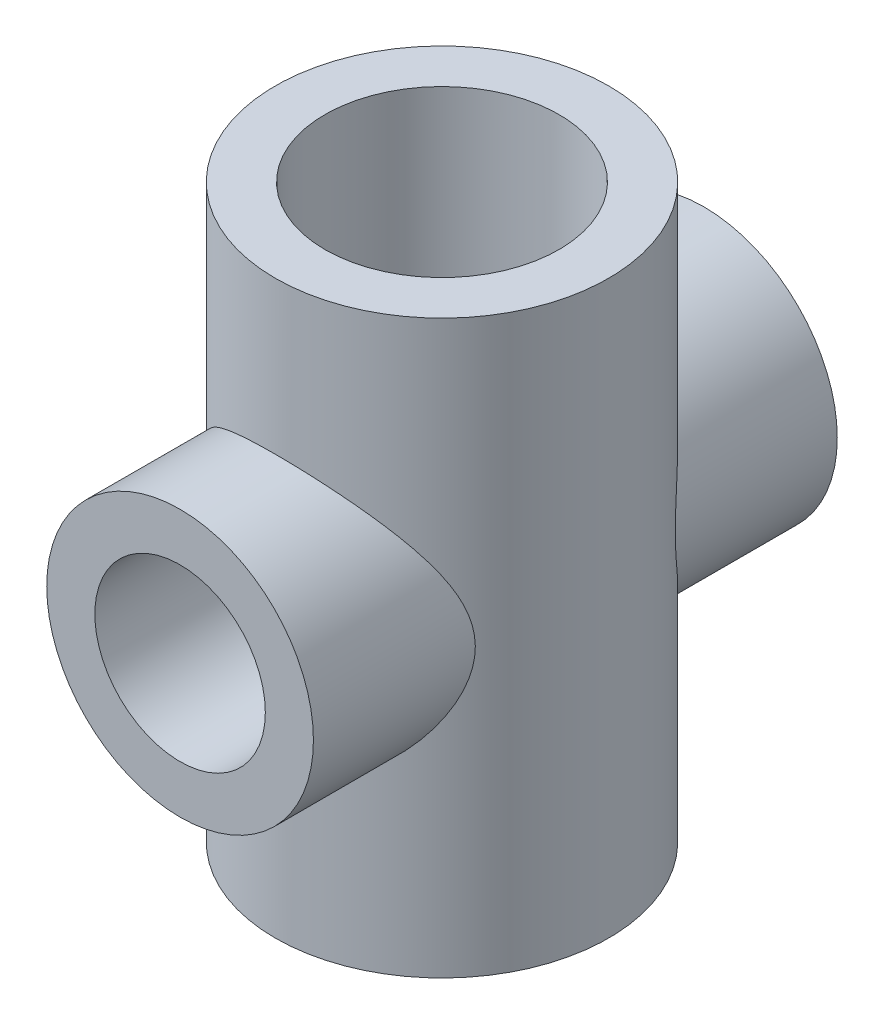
ISO-10303-21;
HEADER;
FILE_DESCRIPTION(('STEP AP214'),'2;1');
FILE_NAME('part.step','',(''),(''),'','','');
FILE_SCHEMA(('AUTOMOTIVE_DESIGN { 1 0 10303 214 1 1 1 1 }'));
ENDSEC;
DATA;
#1=APPLICATION_CONTEXT('core data for automotive mechanical design processes');
#2=APPLICATION_PROTOCOL_DEFINITION('international standard','automotive_design',2000,#1);
#3=PRODUCT_CONTEXT('',#1,'mechanical');
#4=PRODUCT('Part','Part','',(#3));
#5=PRODUCT_RELATED_PRODUCT_CATEGORY('part','',(#4));
#6=PRODUCT_DEFINITION_FORMATION('','',#4);
#7=PRODUCT_DEFINITION_CONTEXT('part definition',#1,'design');
#8=PRODUCT_DEFINITION('design','',#6,#7);
#9=PRODUCT_DEFINITION_SHAPE('','',#8);
#10=(LENGTH_UNIT() NAMED_UNIT(*) SI_UNIT(.MILLI.,.METRE.));
#11=(NAMED_UNIT(*) PLANE_ANGLE_UNIT() SI_UNIT($,.RADIAN.));
#12=(NAMED_UNIT(*) SI_UNIT($,.STERADIAN.) SOLID_ANGLE_UNIT());
#13=UNCERTAINTY_MEASURE_WITH_UNIT(LENGTH_MEASURE(1.E-05),#10,'distance_accuracy_value','');
#14=(GEOMETRIC_REPRESENTATION_CONTEXT(3) GLOBAL_UNCERTAINTY_ASSIGNED_CONTEXT((#13)) GLOBAL_UNIT_ASSIGNED_CONTEXT((#10,
#11,#12)) REPRESENTATION_CONTEXT('',''));
#15=CARTESIAN_POINT('',(0.,0.,0.));
#16=DIRECTION('',(0.,0.,1.));
#17=DIRECTION('',(1.,0.,0.));
#18=AXIS2_PLACEMENT_3D('',#15,#16,#17);
#19=CARTESIAN_POINT('',(0.,120.,0.));
#20=DIRECTION('',(0.,-1.,0.));
#21=DIRECTION('',(0.,0.,-1.));
#22=AXIS2_PLACEMENT_3D('',#19,#20,#21);
#23=CYLINDRICAL_SURFACE('',#22,35.);
#24=CARTESIAN_POINT('',(-28.,60.,21.));
#25=CARTESIAN_POINT('',(-27.9999947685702,59.474213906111,21.0000124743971));
#26=CARTESIAN_POINT('',(-27.98514991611,58.9482355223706,21.0198454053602));
#27=CARTESIAN_POINT('',(-27.926121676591,57.9006203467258,21.0981995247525));
#28=CARTESIAN_POINT('',(-27.8819182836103,57.3789867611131,21.1567470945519));
#29=CARTESIAN_POINT('',(-27.7650373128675,56.3427702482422,21.3099025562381));
#30=CARTESIAN_POINT('',(-27.6922780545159,55.8282119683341,21.4046138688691));
#31=CARTESIAN_POINT('',(-27.5197781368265,54.8107597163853,21.6259433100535));
#32=CARTESIAN_POINT('',(-27.4200378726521,54.3078655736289,21.7525609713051));
#33=CARTESIAN_POINT('',(-27.1559770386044,53.1426327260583,22.0819285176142));
#34=CARTESIAN_POINT('',(-26.9812636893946,52.4857966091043,22.2958330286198));
#35=CARTESIAN_POINT('',(-26.5893502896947,51.1988940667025,22.761789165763));
#36=CARTESIAN_POINT('',(-26.372130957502,50.5688399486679,23.0138580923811));
#37=CARTESIAN_POINT('',(-25.8976782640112,49.3347164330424,23.5465010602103));
#38=CARTESIAN_POINT('',(-25.6403555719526,48.7307089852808,23.8271382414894));
#39=CARTESIAN_POINT('',(-25.0882579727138,47.5499367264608,24.4077844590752));
#40=CARTESIAN_POINT('',(-24.7934840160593,46.9731712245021,24.7077930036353));
#41=CARTESIAN_POINT('',(-24.0547522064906,45.6424480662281,25.4307614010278));
#42=CARTESIAN_POINT('',(-23.5953944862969,44.8998399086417,25.8589500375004));
#43=CARTESIAN_POINT('',(-22.6119321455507,43.4634256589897,26.7232044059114));
#44=CARTESIAN_POINT('',(-22.0878042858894,42.7696372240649,27.1592729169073));
#45=CARTESIAN_POINT('',(-20.9763200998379,41.4325808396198,28.0266056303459));
#46=CARTESIAN_POINT('',(-20.3890148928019,40.7892727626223,28.4578734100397));
#47=CARTESIAN_POINT('',(-19.151513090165,39.5553789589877,29.3049749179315));
#48=CARTESIAN_POINT('',(-18.5013375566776,38.9647757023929,29.7208137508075));
#49=CARTESIAN_POINT('',(-17.2733726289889,37.9515780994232,30.4472379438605));
#50=CARTESIAN_POINT('',(-16.7066377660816,37.5188356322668,30.762393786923));
#51=CARTESIAN_POINT('',(-15.5338193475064,36.6930335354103,31.370954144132));
#52=CARTESIAN_POINT('',(-14.927737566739,36.299972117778,31.6643596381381));
#53=CARTESIAN_POINT('',(-13.6783930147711,35.5576422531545,32.2237401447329));
#54=CARTESIAN_POINT('',(-13.0351781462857,35.2083191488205,32.489749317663));
#55=CARTESIAN_POINT('',(-11.7131470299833,34.5570274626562,32.9894107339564));
#56=CARTESIAN_POINT('',(-11.0343367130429,34.2550510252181,33.2230683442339));
#57=CARTESIAN_POINT('',(-9.75694056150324,33.7474743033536,33.6180609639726));
#58=CARTESIAN_POINT('',(-9.16312897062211,33.5341857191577,33.7849811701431));
#59=CARTESIAN_POINT('',(-7.95560960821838,33.1465045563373,34.0895264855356));
#60=CARTESIAN_POINT('',(-7.34190387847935,32.972108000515,34.2271545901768));
#61=CARTESIAN_POINT('',(-6.09823503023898,32.6646446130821,34.4704630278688));
#62=CARTESIAN_POINT('',(-5.46827820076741,32.5315620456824,34.5761555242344));
#63=CARTESIAN_POINT('',(-4.19598769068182,32.3086521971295,34.7535059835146));
#64=CARTESIAN_POINT('',(-3.55365386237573,32.2188254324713,34.8251635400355));
#65=CARTESIAN_POINT('',(-2.25905016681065,32.0836658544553,34.9330795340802));
#66=CARTESIAN_POINT('',(-1.60675333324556,32.0384903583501,34.969212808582));
#67=CARTESIAN_POINT('',(-0.299588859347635,31.9939667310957,35.0048242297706));
#68=CARTESIAN_POINT('',(0.35527878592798,31.9946186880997,35.0043023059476));
#69=CARTESIAN_POINT('',(1.66231518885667,32.0417385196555,34.9666153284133));
#70=CARTESIAN_POINT('',(2.31448385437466,32.0882079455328,34.9294490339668));
#71=CARTESIAN_POINT('',(3.61095348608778,32.2261638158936,34.8193086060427));
#72=CARTESIAN_POINT('',(4.25525463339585,32.3176492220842,34.7463352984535));
#73=CARTESIAN_POINT('',(5.49635990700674,32.5379289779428,34.5711029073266));
#74=CARTESIAN_POINT('',(6.0938355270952,32.6644112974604,34.4706621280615));
#75=CARTESIAN_POINT('',(7.27400340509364,32.9545177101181,34.2410609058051));
#76=CARTESIAN_POINT('',(7.85669632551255,33.1181401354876,34.1119017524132));
#77=CARTESIAN_POINT('',(9.0044375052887,33.4805287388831,33.8270573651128));
#78=CARTESIAN_POINT('',(9.56948345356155,33.6792994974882,33.6713686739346));
#79=CARTESIAN_POINT('',(10.679500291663,34.1097949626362,33.3359343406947));
#80=CARTESIAN_POINT('',(11.2244699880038,34.3415216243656,33.1561872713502));
#81=CARTESIAN_POINT('',(12.3439138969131,34.8595168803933,32.7568937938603));
#82=CARTESIAN_POINT('',(12.9161785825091,35.1488884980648,32.5351818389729));
#83=CARTESIAN_POINT('',(14.03261542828,35.7617796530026,32.0694813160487));
#84=CARTESIAN_POINT('',(14.5767860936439,36.0853010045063,31.8254915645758));
#85=CARTESIAN_POINT('',(15.6360417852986,36.7640358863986,31.3186691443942));
#86=CARTESIAN_POINT('',(16.151116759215,37.1192602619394,31.0558300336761));
#87=CARTESIAN_POINT('',(17.1512957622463,37.8590858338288,30.514855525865));
#88=CARTESIAN_POINT('',(17.6363957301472,38.2436909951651,30.2367180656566));
#89=CARTESIAN_POINT('',(18.6730021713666,39.1224755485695,29.6100895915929));
#90=CARTESIAN_POINT('',(19.2175969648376,39.6229040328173,29.25891068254));
#91=CARTESIAN_POINT('',(20.2621125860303,40.6611982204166,28.5455228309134));
#92=CARTESIAN_POINT('',(20.7620260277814,41.199070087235,28.1833120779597));
#93=CARTESIAN_POINT('',(21.7173484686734,42.3111677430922,27.4539303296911));
#94=CARTESIAN_POINT('',(22.1727049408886,42.8854351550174,27.0867540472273));
#95=CARTESIAN_POINT('',(23.0377131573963,44.0688677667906,26.354972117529));
#96=CARTESIAN_POINT('',(23.4473703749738,44.6780287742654,25.9903661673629));
#97=CARTESIAN_POINT('',(24.1828473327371,45.8708692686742,25.3064655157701));
#98=CARTESIAN_POINT('',(24.5129418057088,46.4513493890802,24.9861896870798));
#99=CARTESIAN_POINT('',(25.1338962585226,47.6412873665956,24.3614695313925));
#100=CARTESIAN_POINT('',(25.424751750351,48.2507485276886,24.0570270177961));
#101=CARTESIAN_POINT('',(25.9648354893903,49.4981767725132,23.4730721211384));
#102=CARTESIAN_POINT('',(26.2141343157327,50.1360931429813,23.1935178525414));
#103=CARTESIAN_POINT('',(26.5550509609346,51.1147038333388,22.8004268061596));
#104=CARTESIAN_POINT('',(26.6631701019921,51.4444762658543,22.673787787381));
#105=CARTESIAN_POINT('',(26.8680244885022,52.111339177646,22.4306599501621));
#106=CARTESIAN_POINT('',(26.9647569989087,52.4484313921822,22.3141735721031));
#107=CARTESIAN_POINT('',(27.1821436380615,53.2640753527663,22.0492838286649));
#108=CARTESIAN_POINT('',(27.2971776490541,53.7459647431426,21.9064210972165));
#109=CARTESIAN_POINT('',(27.5025801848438,54.7220561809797,21.6479878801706));
#110=CARTESIAN_POINT('',(27.5929567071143,55.2162541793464,21.5324085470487));
#111=CARTESIAN_POINT('',(27.7474665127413,56.2141741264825,21.332933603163));
#112=CARTESIAN_POINT('',(27.8116473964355,56.7178770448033,21.2489805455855));
#113=CARTESIAN_POINT('',(27.9127035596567,57.7326445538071,21.1160605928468));
#114=CARTESIAN_POINT('',(27.9495794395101,58.2437089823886,21.0670929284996));
#115=CARTESIAN_POINT('',(27.9953050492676,59.2723610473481,21.0062941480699));
#116=CARTESIAN_POINT('',(28.0039882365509,59.7899693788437,20.9946837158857));
#117=CARTESIAN_POINT('',(27.9926427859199,60.8242896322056,21.009807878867));
#118=CARTESIAN_POINT('',(27.9726146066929,61.3410015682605,21.0365418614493));
#119=CARTESIAN_POINT('',(27.9042990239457,62.3698640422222,21.1270742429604));
#120=CARTESIAN_POINT('',(27.8559777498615,62.8820083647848,21.1909170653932));
#121=CARTESIAN_POINT('',(27.7321333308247,63.8975127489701,21.3527300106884));
#122=CARTESIAN_POINT('',(27.6566060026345,64.4008714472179,21.4507053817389));
#123=CARTESIAN_POINT('',(27.4572780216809,65.5226492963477,21.7055352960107));
#124=CARTESIAN_POINT('',(27.3260868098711,66.1377927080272,21.8710258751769));
#125=CARTESIAN_POINT('',(27.026130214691,67.3468839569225,22.2406109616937));
#126=CARTESIAN_POINT('',(26.8573531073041,67.9408251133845,22.4447175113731));
#127=CARTESIAN_POINT('',(26.4844943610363,69.1075563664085,22.8835000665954));
#128=CARTESIAN_POINT('',(26.2803270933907,69.6802909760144,23.1182498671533));
#129=CARTESIAN_POINT('',(25.8391696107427,70.8028255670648,23.6103073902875));
#130=CARTESIAN_POINT('',(25.602177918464,71.3526245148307,23.8676161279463));
#131=CARTESIAN_POINT('',(24.9812819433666,72.6762744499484,24.5197930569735));
#132=CARTESIAN_POINT('',(24.5797916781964,73.4374624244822,24.9237066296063));
#133=CARTESIAN_POINT('',(23.7136097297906,74.912976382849,25.7492386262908));
#134=CARTESIAN_POINT('',(23.2488920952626,75.6272829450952,26.1708642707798));
#135=CARTESIAN_POINT('',(22.2574675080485,77.0096782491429,27.0190900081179));
#136=CARTESIAN_POINT('',(21.7306998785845,77.6777207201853,27.4456945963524));
#137=CARTESIAN_POINT('',(20.6164276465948,78.9654340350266,28.2922708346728));
#138=CARTESIAN_POINT('',(20.0289325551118,79.585112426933,28.7122435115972));
#139=CARTESIAN_POINT('',(18.7847228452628,80.7819570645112,29.5415140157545));
#140=CARTESIAN_POINT('',(18.1271363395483,81.3583861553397,29.9505723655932));
#141=CARTESIAN_POINT('',(16.7506190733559,82.4541939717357,30.7416196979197));
#142=CARTESIAN_POINT('',(16.0316787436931,82.9735637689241,31.1236044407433));
#143=CARTESIAN_POINT('',(14.5361093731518,83.9477569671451,31.8494877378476));
#144=CARTESIAN_POINT('',(13.7596442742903,84.402753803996,32.1934880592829));
#145=CARTESIAN_POINT('',(12.5537679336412,85.0321506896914,32.6740010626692));
#146=CARTESIAN_POINT('',(12.1450128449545,85.2330727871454,32.8282362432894));
#147=CARTESIAN_POINT('',(11.3141748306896,85.6163767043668,33.1237653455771));
#148=CARTESIAN_POINT('',(10.8920888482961,85.7987542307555,33.2650562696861));
#149=CARTESIAN_POINT('',(9.88367873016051,86.2050359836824,33.5809810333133));
#150=CARTESIAN_POINT('',(9.2921554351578,86.4207552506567,33.7496889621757));
#151=CARTESIAN_POINT('',(8.08918779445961,86.813527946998,34.0580459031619));
#152=CARTESIAN_POINT('',(7.47774868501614,86.9905914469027,34.1977024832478));
#153=CARTESIAN_POINT('',(6.23846313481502,87.3036580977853,34.4453272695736));
#154=CARTESIAN_POINT('',(5.61062557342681,87.439682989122,34.5533122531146));
#155=CARTESIAN_POINT('',(4.34226943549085,87.6687544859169,34.7355027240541));
#156=CARTESIAN_POINT('',(3.701750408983,87.7617995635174,34.8097070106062));
#157=CARTESIAN_POINT('',(2.41031137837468,87.9036538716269,34.9229446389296));
#158=CARTESIAN_POINT('',(1.7593617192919,87.9522986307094,34.9618472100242));
#159=CARTESIAN_POINT('',(0.454491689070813,88.0039240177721,35.0031358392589));
#160=CARTESIAN_POINT('',(-0.199428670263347,88.0069048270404,35.005522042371));
#161=CARTESIAN_POINT('',(-1.50501755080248,87.9671504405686,34.9737239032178));
#162=CARTESIAN_POINT('',(-2.1566859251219,87.9244123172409,34.9395372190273));
#163=CARTESIAN_POINT('',(-3.45258240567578,87.7939518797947,34.835358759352));
#164=CARTESIAN_POINT('',(-4.09681067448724,87.7062305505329,34.7653677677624));
#165=CARTESIAN_POINT('',(-5.33881404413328,87.4931370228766,34.5957897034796));
#166=CARTESIAN_POINT('',(-5.93722737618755,87.3700366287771,34.4979914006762));
#167=CARTESIAN_POINT('',(-7.11956719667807,87.0865526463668,34.2735151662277));
#168=CARTESIAN_POINT('',(-7.70349432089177,86.9261706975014,34.1468385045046));
#169=CARTESIAN_POINT('',(-8.85395673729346,86.5700984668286,33.8667690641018));
#170=CARTESIAN_POINT('',(-9.42048962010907,86.3744033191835,33.713372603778));
#171=CARTESIAN_POINT('',(-10.5336799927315,85.949884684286,33.3823136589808));
#172=CARTESIAN_POINT('',(-11.080336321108,85.7210592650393,33.2046497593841));
#173=CARTESIAN_POINT('',(-12.2017223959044,85.2097638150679,32.8101101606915));
#174=CARTESIAN_POINT('',(-12.7743362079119,84.9242841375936,32.591124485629));
#175=CARTESIAN_POINT('',(-13.8917782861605,84.319175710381,32.1307291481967));
#176=CARTESIAN_POINT('',(-14.4366051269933,83.9995452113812,31.8893183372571));
#177=CARTESIAN_POINT('',(-15.4974339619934,83.3285997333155,31.3874807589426));
#178=CARTESIAN_POINT('',(-16.0134268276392,82.9772748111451,31.1270480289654));
#179=CARTESIAN_POINT('',(-17.0156939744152,82.2452547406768,30.5906737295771));
#180=CARTESIAN_POINT('',(-17.5019642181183,81.8645556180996,30.3147300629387));
#181=CARTESIAN_POINT('',(-18.5407487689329,80.9949669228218,29.6930647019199));
#182=CARTESIAN_POINT('',(-19.0864555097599,80.4998799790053,29.3446194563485));
#183=CARTESIAN_POINT('',(-20.1336213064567,79.4724301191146,28.6362875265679));
#184=CARTESIAN_POINT('',(-20.6350732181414,78.9400612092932,28.2763990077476));
#185=CARTESIAN_POINT('',(-21.5939171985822,77.8391770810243,27.5511243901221));
#186=CARTESIAN_POINT('',(-22.0512565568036,77.2706199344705,27.1857323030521));
#187=CARTESIAN_POINT('',(-22.920700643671,76.0988731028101,26.4568167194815));
#188=CARTESIAN_POINT('',(-23.332810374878,75.495687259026,26.0932930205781));
#189=CARTESIAN_POINT('',(-24.0795146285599,74.3048990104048,25.4049910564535));
#190=CARTESIAN_POINT('',(-24.4176818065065,73.71997501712,25.0794553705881));
#191=CARTESIAN_POINT('',(-25.0539446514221,72.5204170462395,24.4438540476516));
#192=CARTESIAN_POINT('',(-25.3520349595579,71.9057791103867,24.1337904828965));
#193=CARTESIAN_POINT('',(-25.9057691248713,70.6472145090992,23.5383976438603));
#194=CARTESIAN_POINT('',(-26.1614711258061,70.0033295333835,23.2530347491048));
#195=CARTESIAN_POINT('',(-26.6280006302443,68.6854818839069,22.7172999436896));
#196=CARTESIAN_POINT('',(-26.8388506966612,68.0115345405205,22.4669104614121));
#197=CARTESIAN_POINT('',(-27.1566823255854,66.8386161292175,22.080702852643));
#198=CARTESIAN_POINT('',(-27.2759352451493,66.3468993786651,21.9329095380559));
#199=CARTESIAN_POINT('',(-27.4888017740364,65.3502617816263,21.6655259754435));
#200=CARTESIAN_POINT('',(-27.5824144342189,64.8453404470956,21.5459367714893));
#201=CARTESIAN_POINT('',(-27.7421243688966,63.8261881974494,21.3399047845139));
#202=CARTESIAN_POINT('',(-27.8083100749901,63.3119928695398,21.2533555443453));
#203=CARTESIAN_POINT('',(-27.9121799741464,62.2761185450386,21.116763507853));
#204=CARTESIAN_POINT('',(-27.9498841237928,61.7544450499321,21.0666951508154));
#205=CARTESIAN_POINT('',(-27.9819368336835,61.0263281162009,21.024066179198));
#206=CARTESIAN_POINT('',(-27.988706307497,60.8212488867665,21.0150512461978));
#207=CARTESIAN_POINT('',(-27.9977392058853,60.4107895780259,21.0030153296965));
#208=CARTESIAN_POINT('',(-28.0000020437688,60.2054094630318,20.9999951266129));
#209=CARTESIAN_POINT('',(-28.,60.,21.));
#210=B_SPLINE_CURVE_WITH_KNOTS('',3,(#24,#25,#26,#27,#28,#29,#30,#31,#32,#33,#34,#35,#36,#37,
#38,#39,#40,#41,#42,#43,#44,#45,#46,#47,#48,#49,#50,#51,#52,#53,#54,#55,#56,#57,#58,#59,#60,#61,
#62,#63,#64,#65,#66,#67,#68,#69,#70,#71,#72,#73,#74,#75,#76,#77,#78,#79,#80,#81,#82,#83,#84,#85,
#86,#87,#88,#89,#90,#91,#92,#93,#94,#95,#96,#97,#98,#99,#100,#101,#102,#103,#104,#105,#106,#107,
#108,#109,#110,#111,#112,#113,#114,#115,#116,#117,#118,#119,#120,#121,#122,#123,#124,#125,#126,
#127,#128,#129,#130,#131,#132,#133,#134,#135,#136,#137,#138,#139,#140,#141,#142,#143,#144,#145,
#146,#147,#148,#149,#150,#151,#152,#153,#154,#155,#156,#157,#158,#159,#160,#161,#162,#163,#164,
#165,#166,#167,#168,#169,#170,#171,#172,#173,#174,#175,#176,#177,#178,#179,#180,#181,#182,#183,
#184,#185,#186,#187,#188,#189,#190,#191,#192,#193,#194,#195,#196,#197,#198,#199,#200,#201,#202,
#203,#204,#205,#206,#207,#208,#209),.UNSPECIFIED.,.T.,.F.,(4,2,2,2,2,2,2,2,2,2,2,2,2,2,2,2,2,2,
2,2,2,2,2,2,2,2,2,2,2,2,2,2,2,2,2,2,2,2,2,2,2,2,2,2,2,2,2,2,2,2,2,2,2,2,2,2,2,2,2,2,2,2,2,2,2,2,
2,2,2,2,2,2,2,2,2,2,2,2,2,2,2,2,2,2,2,2,2,2,2,2,2,2,4),(0.,1.57712204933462,3.15531990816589,
4.73806530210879,6.32078751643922,8.45501711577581,10.5902171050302,12.7302431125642,
14.870214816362,17.7840668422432,20.6989673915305,23.6115268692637,26.5231139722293,
28.8598223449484,31.1964253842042,33.5300787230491,35.8633444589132,37.8193585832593,
39.7751725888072,41.7302407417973,43.6853322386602,45.6472877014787,47.6092469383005,
49.5712726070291,51.533253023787,53.3880168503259,55.2426974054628,57.0976198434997,
58.9526523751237,60.9862490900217,63.0199538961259,65.0543570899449,67.0890353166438,
69.542944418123,71.9972584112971,74.4544317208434,76.9113104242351,79.1314829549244,
81.3519092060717,83.5685250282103,84.6764828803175,85.7847063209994,87.3301808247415,
88.8751534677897,90.4173060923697,91.9594248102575,93.5106368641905,95.061824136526,
96.6148721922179,98.1681591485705,100.116272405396,102.064994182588,104.01849856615,
105.972090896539,108.820084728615,111.669251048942,114.521226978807,117.372756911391,
120.265182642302,123.158060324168,126.042989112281,127.485004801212,128.927353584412,
130.880797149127,132.833731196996,134.785628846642,136.737595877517,138.696764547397,
140.655925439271,142.615211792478,144.574455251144,146.428612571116,148.282688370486,
150.137019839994,151.991459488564,154.018330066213,156.045304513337,158.072917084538,
160.100804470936,162.543678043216,164.986945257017,167.433096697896,169.878977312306,
172.127243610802,174.375810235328,176.621266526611,178.865590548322,180.445607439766,
182.025682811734,183.600623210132,185.174459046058,185.790514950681,186.406651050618),.UNSPECIFIED.);
#211=CARTESIAN_POINT('',(-28.,60.,21.));
#212=VERTEX_POINT('',#211);
#213=EDGE_CURVE('E41',#212,#212,#210,.T.);
#214=ORIENTED_EDGE('',*,*,#213,.F.);
#215=EDGE_LOOP('',(#214));
#216=FACE_BOUND('',#215,.T.);
#217=CARTESIAN_POINT('',(0.,120.,0.));
#218=DIRECTION('',(0.,1.,0.));
#219=DIRECTION('',(0.,0.,1.));
#220=AXIS2_PLACEMENT_3D('',#217,#218,#219);
#221=CIRCLE('',#220,35.);
#222=CARTESIAN_POINT('',(0.,120.,35.));
#223=VERTEX_POINT('',#222);
#224=EDGE_CURVE('E46',#223,#223,#221,.T.);
#225=ORIENTED_EDGE('',*,*,#224,.F.);
#226=EDGE_LOOP('',(#225));
#227=FACE_BOUND('',#226,.T.);
#228=CARTESIAN_POINT('',(0.,0.,0.));
#229=DIRECTION('',(0.,1.,0.));
#230=DIRECTION('',(0.,0.,1.));
#231=AXIS2_PLACEMENT_3D('',#228,#229,#230);
#232=CIRCLE('',#231,35.);
#233=CARTESIAN_POINT('',(0.,0.,35.));
#234=VERTEX_POINT('',#233);
#235=EDGE_CURVE('E91',#234,#234,#232,.T.);
#236=ORIENTED_EDGE('',*,*,#235,.T.);
#237=EDGE_LOOP('',(#236));
#238=FACE_BOUND('',#237,.T.);
#239=CARTESIAN_POINT('',(0.,88.,-35.));
#240=CARTESIAN_POINT('',(0.672323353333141,87.9999945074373,-34.9999946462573));
#241=CARTESIAN_POINT('',(1.34475015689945,87.9757413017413,-34.9805837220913));
#242=CARTESIAN_POINT('',(2.68420158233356,87.8791380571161,-34.9033740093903));
#243=CARTESIAN_POINT('',(3.35122315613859,87.806762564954,-34.8455549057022));
#244=CARTESIAN_POINT('',(4.67545105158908,87.6150066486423,-34.6927259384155));
#245=CARTESIAN_POINT('',(5.3326361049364,87.4955363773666,-34.5976449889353));
#246=CARTESIAN_POINT('',(6.63094980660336,87.211616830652,-34.3724399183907));
#247=CARTESIAN_POINT('',(7.27208023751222,87.0471725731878,-34.2423197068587));
#248=CARTESIAN_POINT('',(8.53023187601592,86.6770021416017,-33.9506927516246));
#249=CARTESIAN_POINT('',(9.14738128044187,86.471547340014,-33.7893925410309));
#250=CARTESIAN_POINT('',(10.3586750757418,86.0214404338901,-33.4379364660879));
#251=CARTESIAN_POINT('',(10.9528193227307,85.7767880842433,-33.2477804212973));
#252=CARTESIAN_POINT('',(12.1155042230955,85.251169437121,-32.8419498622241));
#253=CARTESIAN_POINT('',(12.6840512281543,84.9702122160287,-32.6262817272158));
#254=CARTESIAN_POINT('',(13.794090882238,84.3745746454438,-32.1726996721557));
#255=CARTESIAN_POINT('',(14.3355779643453,84.0598873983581,-31.9347812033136));
#256=CARTESIAN_POINT('',(15.2183563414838,83.5069705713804,-31.5207219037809));
#257=CARTESIAN_POINT('',(15.5674163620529,83.2772157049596,-31.3496948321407));
#258=CARTESIAN_POINT('',(16.2523074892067,82.8042900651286,-31.0001662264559));
#259=CARTESIAN_POINT('',(16.5881413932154,82.5611221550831,-30.8216662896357));
#260=CARTESIAN_POINT('',(17.5758724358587,81.8121918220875,-30.2762993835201));
#261=CARTESIAN_POINT('',(18.2078747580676,81.2870809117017,-29.8996241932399));
#262=CARTESIAN_POINT('',(19.419132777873,80.1883131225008,-29.1275586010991));
#263=CARTESIAN_POINT('',(19.9982440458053,79.6145311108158,-28.7321211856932));
#264=CARTESIAN_POINT('',(21.101448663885,78.4224937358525,-27.9319349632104));
#265=CARTESIAN_POINT('',(21.6255482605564,77.8042434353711,-27.5271872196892));
#266=CARTESIAN_POINT('',(22.6260315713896,76.5148161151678,-26.7111551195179));
#267=CARTESIAN_POINT('',(23.1015403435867,75.8429623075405,-26.2998675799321));
#268=CARTESIAN_POINT('',(23.9943910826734,74.4551109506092,-25.4879035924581));
#269=CARTESIAN_POINT('',(24.4117146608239,73.7390995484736,-25.0872305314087));
#270=CARTESIAN_POINT('',(25.1847685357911,72.2645320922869,-24.3110372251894));
#271=CARTESIAN_POINT('',(25.5406656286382,71.5060988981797,-23.9354506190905));
#272=CARTESIAN_POINT('',(26.1882763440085,69.944228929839,-23.2250896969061));
#273=CARTESIAN_POINT('',(26.480044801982,69.1408313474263,-22.8902806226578));
#274=CARTESIAN_POINT('',(26.8844451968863,67.8405190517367,-22.4115880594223));
#275=CARTESIAN_POINT('',(27.0205179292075,67.3584166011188,-22.2470245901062));
#276=CARTESIAN_POINT('',(27.2680746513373,66.3801683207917,-21.9428918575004));
#277=CARTESIAN_POINT('',(27.3795625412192,65.8840247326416,-21.8033186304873));
#278=CARTESIAN_POINT('',(27.5761573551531,64.8802147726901,-21.5541357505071));
#279=CARTESIAN_POINT('',(27.6613197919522,64.3725751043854,-21.4444631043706));
#280=CARTESIAN_POINT('',(27.8040282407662,63.3472155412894,-21.2591101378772));
#281=CARTESIAN_POINT('',(27.8615745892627,62.8294957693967,-21.1834294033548));
#282=CARTESIAN_POINT('',(27.9481602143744,61.7828270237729,-21.0690675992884));
#283=CARTESIAN_POINT('',(27.976939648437,61.2538190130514,-21.0307238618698));
#284=CARTESIAN_POINT('',(28.0043505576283,60.1936432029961,-20.9942109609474));
#285=CARTESIAN_POINT('',(28.0029835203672,59.6624755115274,-20.9960398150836));
#286=CARTESIAN_POINT('',(27.9701281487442,58.6023673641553,-21.0397874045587));
#287=CARTESIAN_POINT('',(27.9386179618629,58.0734288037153,-21.0817352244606));
#288=CARTESIAN_POINT('',(27.8462422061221,57.0225548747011,-21.2035976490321));
#289=CARTESIAN_POINT('',(27.7853725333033,56.5006204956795,-21.2835175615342));
#290=CARTESIAN_POINT('',(27.6239001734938,55.3864789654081,-21.4927943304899));
#291=CARTESIAN_POINT('',(27.5185724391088,54.796046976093,-21.6279278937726));
#292=CARTESIAN_POINT('',(27.2729525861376,53.6329208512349,-21.9368375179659));
#293=CARTESIAN_POINT('',(27.1326529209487,53.0602305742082,-22.1106219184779));
#294=CARTESIAN_POINT('',(26.8191822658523,51.9331214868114,-22.4898206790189));
#295=CARTESIAN_POINT('',(26.6459309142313,51.3787513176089,-22.6953121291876));
#296=CARTESIAN_POINT('',(26.2689198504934,50.2904394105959,-23.1306474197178));
#297=CARTESIAN_POINT('',(26.0651576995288,49.7564993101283,-23.360493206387));
#298=CARTESIAN_POINT('',(25.5216398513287,48.4517559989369,-23.9557533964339));
#299=CARTESIAN_POINT('',(25.164230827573,47.6933593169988,-24.3323257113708));
#300=CARTESIAN_POINT('',(24.389058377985,46.2207914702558,-25.1092714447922));
#301=CARTESIAN_POINT('',(23.9712670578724,45.5066409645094,-25.5096558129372));
#302=CARTESIAN_POINT('',(23.0769895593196,44.1213069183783,-26.3214309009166));
#303=CARTESIAN_POINT('',(22.6004353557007,43.4501745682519,-26.7328339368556));
#304=CARTESIAN_POINT('',(21.5901961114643,42.1523242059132,-27.5551766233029));
#305=CARTESIAN_POINT('',(21.0565204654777,41.5255989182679,-27.9661163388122));
#306=CARTESIAN_POINT('',(19.9174086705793,40.301929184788,-28.788949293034));
#307=CARTESIAN_POINT('',(19.3104331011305,39.7062323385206,-29.200573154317));
#308=CARTESIAN_POINT('',(18.0371845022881,38.5666127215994,-30.0037802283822));
#309=CARTESIAN_POINT('',(17.3709027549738,38.0226975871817,-30.3953604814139));
#310=CARTESIAN_POINT('',(15.9815165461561,36.9926813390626,-31.1482511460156));
#311=CARTESIAN_POINT('',(15.2585456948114,36.5064506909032,-31.5096288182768));
#312=CARTESIAN_POINT('',(14.1327028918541,35.8244081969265,-32.0224439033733));
#313=CARTESIAN_POINT('',(13.7505744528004,35.6049690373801,-32.1884881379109));
#314=CARTESIAN_POINT('',(12.972729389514,35.1825830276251,-32.5097732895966));
#315=CARTESIAN_POINT('',(12.5770095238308,34.979640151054,-32.6650116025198));
#316=CARTESIAN_POINT('',(11.6018913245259,34.508810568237,-33.0267976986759));
#317=CARTESIAN_POINT('',(11.0158039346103,34.2499069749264,-33.2271663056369));
#318=CARTESIAN_POINT('',(9.81972268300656,33.7704736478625,-33.6000798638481));
#319=CARTESIAN_POINT('',(9.20973480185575,33.5499343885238,-33.772631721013));
#320=CARTESIAN_POINT('',(7.96891986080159,33.1500297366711,-34.0867362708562));
#321=CARTESIAN_POINT('',(7.33810333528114,32.9706438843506,-34.2283043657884));
#322=CARTESIAN_POINT('',(6.05906376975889,32.6555028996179,-34.4777063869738));
#323=CARTESIAN_POINT('',(5.41084027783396,32.5197489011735,-34.5855394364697));
#324=CARTESIAN_POINT('',(4.09803470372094,32.2934654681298,-34.7656055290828));
#325=CARTESIAN_POINT('',(3.43338429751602,32.2031787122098,-34.8376475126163));
#326=CARTESIAN_POINT('',(2.096279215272,32.0705005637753,-34.9436022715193));
#327=CARTESIAN_POINT('',(1.42382455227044,32.02810909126,-34.9775151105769));
#328=CARTESIAN_POINT('',(0.0768660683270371,31.9920023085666,-35.0063968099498));
#329=CARTESIAN_POINT('',(-0.597637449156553,31.9982801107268,-35.0013711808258));
#330=CARTESIAN_POINT('',(-1.94299695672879,32.0593819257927,-34.9525077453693));
#331=CARTESIAN_POINT('',(-2.61385313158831,32.114203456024,-34.9086719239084));
#332=CARTESIAN_POINT('',(-3.89222189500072,32.2649917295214,-34.7883431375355));
#333=CARTESIAN_POINT('',(-4.50045557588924,32.3572569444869,-34.7147902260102));
#334=CARTESIAN_POINT('',(-5.70518810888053,32.5805524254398,-34.5372482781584));
#335=CARTESIAN_POINT('',(-6.30168771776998,32.711580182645,-34.4332612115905));
#336=CARTESIAN_POINT('',(-7.47962988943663,33.0106593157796,-34.196727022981));
#337=CARTESIAN_POINT('',(-8.06106947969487,33.178717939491,-34.0641743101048));
#338=CARTESIAN_POINT('',(-9.20590294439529,33.5497919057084,-33.7727747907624));
#339=CARTESIAN_POINT('',(-9.76929581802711,33.7528091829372,-33.6139265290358));
#340=CARTESIAN_POINT('',(-10.909873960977,34.2051569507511,-33.261877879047));
#341=CARTESIAN_POINT('',(-11.4857625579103,34.456573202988,-33.0671619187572));
#342=CARTESIAN_POINT('',(-12.6124491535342,34.9936870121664,-32.6540385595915));
#343=CARTESIAN_POINT('',(-13.1632464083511,35.2793855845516,-32.4356304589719));
#344=CARTESIAN_POINT('',(-14.2381614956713,35.8824854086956,-31.9783652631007));
#345=CARTESIAN_POINT('',(-14.7622837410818,36.1998813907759,-31.7395115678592));
#346=CARTESIAN_POINT('',(-15.7829982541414,36.8641436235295,-31.2445002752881));
#347=CARTESIAN_POINT('',(-16.2795863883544,37.2110142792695,-30.9883400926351));
#348=CARTESIAN_POINT('',(-17.3358177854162,38.0003980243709,-30.4121108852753));
#349=CARTESIAN_POINT('',(-17.8896255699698,38.4485929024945,-30.0891171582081));
#350=CARTESIAN_POINT('',(-18.9567302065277,39.3809664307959,-29.4284942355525));
#351=CARTESIAN_POINT('',(-19.470022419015,39.8651491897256,-29.0908633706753));
#352=CARTESIAN_POINT('',(-20.4570816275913,40.8687539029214,-28.405452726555));
#353=CARTESIAN_POINT('',(-20.9307365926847,41.3882686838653,-28.0576476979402));
#354=CARTESIAN_POINT('',(-21.8366679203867,42.4599801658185,-27.3584971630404));
#355=CARTESIAN_POINT('',(-22.2689415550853,43.0121790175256,-27.0071514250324));
#356=CARTESIAN_POINT('',(-23.1794820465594,44.2698851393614,-26.2324388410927));
#357=CARTESIAN_POINT('',(-23.6478765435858,44.9829604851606,-25.8097038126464));
#358=CARTESIAN_POINT('',(-24.5217475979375,46.456799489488,-24.9809184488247));
#359=CARTESIAN_POINT('',(-24.9271907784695,47.2175881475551,-24.5748770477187));
#360=CARTESIAN_POINT('',(-25.4847870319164,48.3934206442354,-23.9916225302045));
#361=CARTESIAN_POINT('',(-25.6619765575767,48.7904646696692,-23.8017940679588));
#362=CARTESIAN_POINT('',(-25.9992455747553,49.5966195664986,-23.432919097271));
#363=CARTESIAN_POINT('',(-26.1593241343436,50.0057310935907,-23.25387317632));
#364=CARTESIAN_POINT('',(-26.6124878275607,51.2504836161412,-22.7372950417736));
#365=CARTESIAN_POINT('',(-26.8790895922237,52.1047737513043,-22.4196947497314));
#366=CARTESIAN_POINT('',(-27.2283257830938,53.4535424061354,-21.9921785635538));
#367=CARTESIAN_POINT('',(-27.33906919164,53.9320528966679,-21.8540739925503));
#368=CARTESIAN_POINT('',(-27.5362548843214,54.9010850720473,-21.6050885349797));
#369=CARTESIAN_POINT('',(-27.6227013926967,55.3916046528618,-21.4942029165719));
#370=CARTESIAN_POINT('',(-27.7696938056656,56.3814545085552,-21.3039577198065));
#371=CARTESIAN_POINT('',(-27.830296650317,56.8807628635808,-21.2245288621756));
#372=CARTESIAN_POINT('',(-27.9246647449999,57.8862380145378,-21.1002189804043));
#373=CARTESIAN_POINT('',(-27.9584301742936,58.3924047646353,-21.0553377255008));
#374=CARTESIAN_POINT('',(-27.998454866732,59.4105463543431,-21.0020875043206));
#375=CARTESIAN_POINT('',(-28.0045630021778,59.9225378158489,-20.9939191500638));
#376=CARTESIAN_POINT('',(-27.9887123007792,60.9452875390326,-21.0150456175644));
#377=CARTESIAN_POINT('',(-27.9667539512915,61.4560458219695,-21.0443397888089));
#378=CARTESIAN_POINT('',(-27.8952477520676,62.4729192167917,-21.1390309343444));
#379=CARTESIAN_POINT('',(-27.8456620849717,62.9790269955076,-21.2044773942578));
#380=CARTESIAN_POINT('',(-27.7199533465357,63.9824657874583,-21.3685467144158));
#381=CARTESIAN_POINT('',(-27.6438261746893,64.4797954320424,-21.4671747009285));
#382=CARTESIAN_POINT('',(-27.4420842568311,65.5979620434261,-21.7247692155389));
#383=CARTESIAN_POINT('',(-27.308624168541,66.2152819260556,-21.8928647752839));
#384=CARTESIAN_POINT('',(-27.0038887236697,67.4284325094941,-22.2676486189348));
#385=CARTESIAN_POINT('',(-26.8326009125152,68.0242560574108,-22.4743496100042));
#386=CARTESIAN_POINT('',(-26.4545000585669,69.1944800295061,-22.9182144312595));
#387=CARTESIAN_POINT('',(-26.2476023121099,69.7688253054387,-23.1554505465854));
#388=CARTESIAN_POINT('',(-25.8007669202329,70.8943608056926,-23.6523186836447));
#389=CARTESIAN_POINT('',(-25.5608279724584,71.4455501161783,-23.911951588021));
#390=CARTESIAN_POINT('',(-24.9334158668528,72.7702520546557,-24.5685517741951));
#391=CARTESIAN_POINT('',(-24.5284100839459,73.5311196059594,-24.9743646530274));
#392=CARTESIAN_POINT('',(-23.6550212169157,75.0058204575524,-25.8031593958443));
#393=CARTESIAN_POINT('',(-23.1866123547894,75.7196344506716,-26.2261481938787));
#394=CARTESIAN_POINT('',(-22.18760274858,77.1007952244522,-27.0765778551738));
#395=CARTESIAN_POINT('',(-21.6569432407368,77.7680971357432,-27.5040225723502));
#396=CARTESIAN_POINT('',(-20.5346554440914,79.0540293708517,-28.3517649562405));
#397=CARTESIAN_POINT('',(-19.9430367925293,79.6726673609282,-28.7720637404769));
#398=CARTESIAN_POINT('',(-18.6909836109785,80.8663581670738,-29.6009828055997));
#399=CARTESIAN_POINT('',(-18.029742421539,81.4407263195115,-30.0093751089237));
#400=CARTESIAN_POINT('',(-16.6458427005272,82.5320356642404,-30.7985503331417));
#401=CARTESIAN_POINT('',(-15.9231740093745,83.0489673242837,-31.1793286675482));
#402=CARTESIAN_POINT('',(-14.4199107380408,84.0179766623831,-31.9023423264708));
#403=CARTESIAN_POINT('',(-13.6394604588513,84.4702081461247,-32.2446686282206));
#404=CARTESIAN_POINT('',(-12.4276257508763,85.0950350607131,-32.7222077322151));
#405=CARTESIAN_POINT('',(-12.016858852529,85.2943754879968,-32.8753838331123));
#406=CARTESIAN_POINT('',(-11.1821837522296,85.6742856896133,-33.1685744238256));
#407=CARTESIAN_POINT('',(-10.7582771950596,85.8548578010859,-33.3085905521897));
#408=CARTESIAN_POINT('',(-9.74919283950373,86.2553069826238,-33.6202364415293));
#409=CARTESIAN_POINT('',(-9.15898355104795,86.4671532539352,-33.7860324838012));
#410=CARTESIAN_POINT('',(-7.95894505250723,86.8524165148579,-34.0886794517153));
#411=CARTESIAN_POINT('',(-7.34911731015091,87.0258363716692,-34.2255325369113));
#412=CARTESIAN_POINT('',(-6.11454801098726,87.3315892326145,-34.4674781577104));
#413=CARTESIAN_POINT('',(-5.4898432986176,87.4640142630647,-34.5726418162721));
#414=CARTESIAN_POINT('',(-4.22844398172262,87.6862794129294,-34.7494678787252));
#415=CARTESIAN_POINT('',(-3.5917548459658,87.7761384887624,-34.8211451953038));
#416=CARTESIAN_POINT('',(-2.46244257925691,87.8958457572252,-34.9167190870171));
#417=CARTESIAN_POINT('',(-1.97138067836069,87.9348628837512,-34.9479086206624));
#418=CARTESIAN_POINT('',(-0.986898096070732,87.986944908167,-34.9895533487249));
#419=CARTESIAN_POINT('',(-0.49347691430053,88.0000040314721,-35.00000392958));
#420=CARTESIAN_POINT('',(0.,88.,-35.));
#421=B_SPLINE_CURVE_WITH_KNOTS('',3,(#239,#240,#241,#242,#243,#244,#245,#246,#247,#248,#249,
#250,#251,#252,#253,#254,#255,#256,#257,#258,#259,#260,#261,#262,#263,#264,#265,#266,#267,#268,
#269,#270,#271,#272,#273,#274,#275,#276,#277,#278,#279,#280,#281,#282,#283,#284,#285,#286,#287,
#288,#289,#290,#291,#292,#293,#294,#295,#296,#297,#298,#299,#300,#301,#302,#303,#304,#305,#306,
#307,#308,#309,#310,#311,#312,#313,#314,#315,#316,#317,#318,#319,#320,#321,#322,#323,#324,#325,
#326,#327,#328,#329,#330,#331,#332,#333,#334,#335,#336,#337,#338,#339,#340,#341,#342,#343,#344,
#345,#346,#347,#348,#349,#350,#351,#352,#353,#354,#355,#356,#357,#358,#359,#360,#361,#362,#363,
#364,#365,#366,#367,#368,#369,#370,#371,#372,#373,#374,#375,#376,#377,#378,#379,#380,#381,#382,
#383,#384,#385,#386,#387,#388,#389,#390,#391,#392,#393,#394,#395,#396,#397,#398,#399,#400,#401,
#402,#403,#404,#405,#406,#407,#408,#409,#410,#411,#412,#413,#414,#415,#416,#417,#418,#419,#420),
.UNSPECIFIED.,.T.,.F.,(4,2,2,2,2,2,2,2,2,2,2,2,2,2,2,2,2,2,2,2,2,2,2,2,2,2,2,2,2,2,2,2,2,2,2,2,
2,2,2,2,2,2,2,2,2,2,2,2,2,2,2,2,2,2,2,2,2,2,2,2,2,2,2,2,2,2,2,2,2,2,2,2,2,2,2,2,2,2,2,2,2,2,2,2,
2,2,2,2,2,2,4),(0.,2.01643931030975,4.03394602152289,6.05532049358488,8.07646952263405,
10.0846630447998,12.0928691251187,14.1005741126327,16.1086904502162,17.4628445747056,
18.8167107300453,21.5249155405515,24.2403073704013,26.9553905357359,29.7129573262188,
32.4713936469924,35.2222177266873,37.970680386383,39.5513838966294,41.1318364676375,
42.708933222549,44.2860107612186,45.8772081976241,47.4683271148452,49.0606004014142,
50.6530963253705,52.4946381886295,54.3365777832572,56.1830684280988,58.0297067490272,
60.7829384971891,63.537446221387,66.2951730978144,69.0524471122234,71.8835870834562,
74.7151439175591,77.5402168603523,78.9524010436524,80.3649243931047,82.3768192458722,
84.3882138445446,86.3986062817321,88.4090509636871,90.4301154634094,92.4511765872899,
94.4719516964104,96.4926234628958,98.3492540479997,100.205764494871,102.062638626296,
103.919615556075,105.891264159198,107.862971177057,109.83435094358,111.806025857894,
114.150572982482,116.495388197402,118.846621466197,121.198009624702,124.051213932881,
126.905925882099,128.328652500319,129.751456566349,132.592577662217,134.122041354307,
135.651238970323,137.177049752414,138.702850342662,140.236978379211,141.771079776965,
143.307286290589,144.843730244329,146.801371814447,148.759658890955,150.722670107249,
152.685758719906,155.539884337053,158.395173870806,161.253180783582,164.110736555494,
167.006085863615,169.901914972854,172.790741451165,174.234901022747,175.678880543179,
177.622695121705,179.566364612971,181.505638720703,183.444048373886,184.923760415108,
186.40380159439),.UNSPECIFIED.);
#422=CARTESIAN_POINT('',(0.,88.,-35.));
#423=VERTEX_POINT('',#422);
#424=EDGE_CURVE('E10',#423,#423,#421,.T.);
#425=ORIENTED_EDGE('',*,*,#424,.F.);
#426=EDGE_LOOP('',(#425));
#427=FACE_BOUND('',#426,.T.);
#428=ADVANCED_FACE('F29',(#216,#227,#238,#427),#23,.T.);
#429=CARTESIAN_POINT('',(0.,120.,0.));
#430=DIRECTION('',(0.,1.,0.));
#431=DIRECTION('',(0.,0.,1.));
#432=AXIS2_PLACEMENT_3D('',#429,#430,#431);
#433=PLANE('',#432);
#434=CARTESIAN_POINT('',(0.,120.,0.));
#435=DIRECTION('',(0.,1.,0.));
#436=DIRECTION('',(0.,0.,1.));
#437=AXIS2_PLACEMENT_3D('',#434,#435,#436);
#438=CIRCLE('',#437,24.5715285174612);
#439=CARTESIAN_POINT('',(0.,120.,24.5715285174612));
#440=VERTEX_POINT('',#439);
#441=EDGE_CURVE('E99',#440,#440,#438,.T.);
#442=ORIENTED_EDGE('',*,*,#441,.F.);
#443=EDGE_LOOP('',(#442));
#444=FACE_BOUND('',#443,.T.);
#445=ORIENTED_EDGE('',*,*,#224,.T.);
#446=EDGE_LOOP('',(#445));
#447=FACE_BOUND('',#446,.T.);
#448=ADVANCED_FACE('F65',(#444,#447),#433,.T.);
#449=CARTESIAN_POINT('',(0.,0.,0.));
#450=DIRECTION('',(0.,1.,0.));
#451=DIRECTION('',(0.,0.,1.));
#452=AXIS2_PLACEMENT_3D('',#449,#450,#451);
#453=PLANE('',#452);
#454=CARTESIAN_POINT('',(0.,0.,0.));
#455=DIRECTION('',(0.,1.,0.));
#456=DIRECTION('',(0.,0.,1.));
#457=AXIS2_PLACEMENT_3D('',#454,#455,#456);
#458=CIRCLE('',#457,24.5715285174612);
#459=CARTESIAN_POINT('',(0.,0.,24.5715285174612));
#460=VERTEX_POINT('',#459);
#461=EDGE_CURVE('E55',#460,#460,#458,.T.);
#462=ORIENTED_EDGE('',*,*,#461,.T.);
#463=EDGE_LOOP('',(#462));
#464=FACE_BOUND('',#463,.T.);
#465=ORIENTED_EDGE('',*,*,#235,.F.);
#466=EDGE_LOOP('',(#465));
#467=FACE_BOUND('',#466,.T.);
#468=ADVANCED_FACE('F68',(#464,#467),#453,.F.);
#469=CARTESIAN_POINT('',(0.,60.,55.));
#470=DIRECTION('',(0.,0.,1.));
#471=DIRECTION('',(1.,0.,0.));
#472=AXIS2_PLACEMENT_3D('',#469,#470,#471);
#473=PLANE('',#472);
#474=CARTESIAN_POINT('',(0.,60.,55.));
#475=DIRECTION('',(0.,0.,1.));
#476=DIRECTION('',(1.,0.,0.));
#477=AXIS2_PLACEMENT_3D('',#474,#475,#476);
#478=CIRCLE('',#477,17.9024842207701);
#479=CARTESIAN_POINT('',(17.9024842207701,60.,55.));
#480=VERTEX_POINT('',#479);
#481=EDGE_CURVE('E103',#480,#480,#478,.T.);
#482=ORIENTED_EDGE('',*,*,#481,.F.);
#483=EDGE_LOOP('',(#482));
#484=FACE_BOUND('',#483,.T.);
#485=CARTESIAN_POINT('',(0.,60.,55.));
#486=DIRECTION('',(0.,0.,1.));
#487=DIRECTION('',(1.,0.,0.));
#488=AXIS2_PLACEMENT_3D('',#485,#486,#487);
#489=CIRCLE('',#488,28.);
#490=CARTESIAN_POINT('',(28.,60.,55.));
#491=VERTEX_POINT('',#490);
#492=EDGE_CURVE('E92',#491,#491,#489,.T.);
#493=ORIENTED_EDGE('',*,*,#492,.T.);
#494=EDGE_LOOP('',(#493));
#495=FACE_BOUND('',#494,.T.);
#496=ADVANCED_FACE('F71',(#484,#495),#473,.T.);
#497=CARTESIAN_POINT('',(0.,60.,55.));
#498=DIRECTION('',(0.,0.,-1.));
#499=DIRECTION('',(-1.,0.,0.));
#500=AXIS2_PLACEMENT_3D('',#497,#498,#499);
#501=CYLINDRICAL_SURFACE('',#500,28.);
#502=ORIENTED_EDGE('',*,*,#492,.F.);
#503=EDGE_LOOP('',(#502));
#504=FACE_BOUND('',#503,.T.);
#505=ORIENTED_EDGE('',*,*,#213,.T.);
#506=EDGE_LOOP('',(#505));
#507=FACE_BOUND('',#506,.T.);
#508=ADVANCED_FACE('F62',(#504,#507),#501,.T.);
#509=CARTESIAN_POINT('',(0.,60.,-55.));
#510=DIRECTION('',(0.,0.,1.));
#511=DIRECTION('',(1.,0.,0.));
#512=AXIS2_PLACEMENT_3D('',#509,#510,#511);
#513=CIRCLE('',#512,28.);
#514=CARTESIAN_POINT('',(28.,60.,-55.));
#515=VERTEX_POINT('',#514);
#516=EDGE_CURVE('E95',#515,#515,#513,.T.);
#517=ORIENTED_EDGE('',*,*,#516,.T.);
#518=EDGE_LOOP('',(#517));
#519=FACE_BOUND('',#518,.T.);
#520=ORIENTED_EDGE('',*,*,#424,.T.);
#521=EDGE_LOOP('',(#520));
#522=FACE_BOUND('',#521,.T.);
#523=ADVANCED_FACE('F56',(#519,#522),#501,.T.);
#524=CARTESIAN_POINT('',(0.,60.,-55.));
#525=DIRECTION('',(0.,0.,1.));
#526=DIRECTION('',(1.,0.,0.));
#527=AXIS2_PLACEMENT_3D('',#524,#525,#526);
#528=PLANE('',#527);
#529=CARTESIAN_POINT('',(0.,60.,-55.));
#530=DIRECTION('',(0.,0.,1.));
#531=DIRECTION('',(1.,0.,0.));
#532=AXIS2_PLACEMENT_3D('',#529,#530,#531);
#533=CIRCLE('',#532,17.9024842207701);
#534=CARTESIAN_POINT('',(17.9024842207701,60.,-55.));
#535=VERTEX_POINT('',#534);
#536=EDGE_CURVE('E106',#535,#535,#533,.T.);
#537=ORIENTED_EDGE('',*,*,#536,.T.);
#538=EDGE_LOOP('',(#537));
#539=FACE_BOUND('',#538,.T.);
#540=ORIENTED_EDGE('',*,*,#516,.F.);
#541=EDGE_LOOP('',(#540));
#542=FACE_BOUND('',#541,.T.);
#543=ADVANCED_FACE('F61',(#539,#542),#528,.F.);
#544=CARTESIAN_POINT('',(0.,-148.5,0.));
#545=DIRECTION('',(0.,1.,0.));
#546=DIRECTION('',(0.,0.,1.));
#547=AXIS2_PLACEMENT_3D('',#544,#545,#546);
#548=CYLINDRICAL_SURFACE('',#547,24.5715285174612);
#549=CARTESIAN_POINT('',(0.,42.0975157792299,24.5715285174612));
#550=CARTESIAN_POINT('',(0.440268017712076,42.0975201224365,24.571524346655));
#551=CARTESIAN_POINT('',(0.880658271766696,42.1137863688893,24.5596661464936));
#552=CARTESIAN_POINT('',(1.75798672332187,42.178604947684,24.5125011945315));
#553=CARTESIAN_POINT('',(2.19492262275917,42.2271771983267,24.4771799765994));
#554=CARTESIAN_POINT('',(3.06265832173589,42.3559679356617,24.3838259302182));
#555=CARTESIAN_POINT('',(3.49344202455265,42.4362576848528,24.3257419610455));
#556=CARTESIAN_POINT('',(4.34463690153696,42.6272244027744,24.1882207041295));
#557=CARTESIAN_POINT('',(4.76504952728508,42.7378970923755,24.1087864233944));
#558=CARTESIAN_POINT('',(5.59040865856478,42.9873270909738,23.9308279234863));
#559=CARTESIAN_POINT('',(5.99543266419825,43.1259123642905,23.8324207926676));
#560=CARTESIAN_POINT('',(6.79051281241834,43.4298749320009,23.6181814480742));
#561=CARTESIAN_POINT('',(7.18056847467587,43.5952530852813,23.5023486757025));
#562=CARTESIAN_POINT('',(7.94381587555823,43.9509526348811,23.2554640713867));
#563=CARTESIAN_POINT('',(8.31701660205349,44.1412605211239,23.1244204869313));
#564=CARTESIAN_POINT('',(9.04556624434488,44.5452203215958,22.8492760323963));
#565=CARTESIAN_POINT('',(9.40091260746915,44.7588755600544,22.7051733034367));
#566=CARTESIAN_POINT('',(10.12425949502,45.2283800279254,22.3925969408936));
#567=CARTESIAN_POINT('',(10.4904728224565,45.4862993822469,22.2230987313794));
#568=CARTESIAN_POINT('',(11.1996614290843,46.0262675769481,21.8742722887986));
#569=CARTESIAN_POINT('',(11.542635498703,46.3083176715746,21.6949435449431));
#570=CARTESIAN_POINT('',(12.2052128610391,46.8954985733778,21.3292328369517));
#571=CARTESIAN_POINT('',(12.5247815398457,47.2006622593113,21.1428410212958));
#572=CARTESIAN_POINT('',(13.1395069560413,47.8325585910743,20.7663984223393));
#573=CARTESIAN_POINT('',(13.4346619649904,48.1592927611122,20.576347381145));
#574=CARTESIAN_POINT('',(14.0543001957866,48.8981735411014,20.1594016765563));
#575=CARTESIAN_POINT('',(14.3735526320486,49.3146835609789,19.9324309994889));
#576=CARTESIAN_POINT('',(14.97564115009,50.1762796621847,19.4841249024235));
#577=CARTESIAN_POINT('',(15.2584668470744,50.6213738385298,19.2627911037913));
#578=CARTESIAN_POINT('',(15.7857944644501,51.5390744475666,18.8330603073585));
#579=CARTESIAN_POINT('',(16.0303400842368,52.0116486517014,18.6246487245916));
#580=CARTESIAN_POINT('',(16.3667977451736,52.7406311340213,18.3278579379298));
#581=CARTESIAN_POINT('',(16.4738729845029,52.9869308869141,18.2315819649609));
#582=CARTESIAN_POINT('',(16.6776115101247,53.4862497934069,18.0453960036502));
#583=CARTESIAN_POINT('',(16.7742724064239,53.7392704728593,17.9554874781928));
#584=CARTESIAN_POINT('',(16.9876524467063,54.3386206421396,17.7540952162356));
#585=CARTESIAN_POINT('',(17.1000705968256,54.6875175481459,17.6456232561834));
#586=CARTESIAN_POINT('',(17.3042533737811,55.3959176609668,17.445437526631));
#587=CARTESIAN_POINT('',(17.3960244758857,55.7554175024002,17.3537185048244));
#588=CARTESIAN_POINT('',(17.5575918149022,56.4831088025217,17.1902355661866));
#589=CARTESIAN_POINT('',(17.6274282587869,56.8512830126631,17.1184351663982));
#590=CARTESIAN_POINT('',(17.7441913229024,57.5949531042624,16.9973761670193));
#591=CARTESIAN_POINT('',(17.7911180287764,57.9704489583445,16.9481174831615));
#592=CARTESIAN_POINT('',(17.8613977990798,58.7289620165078,16.8740375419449));
#593=CARTESIAN_POINT('',(17.8845701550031,59.1120146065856,16.8494036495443));
#594=CARTESIAN_POINT('',(17.9061957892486,59.8796014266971,16.8264204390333));
#595=CARTESIAN_POINT('',(17.9046499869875,60.2641356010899,16.8280701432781));
#596=CARTESIAN_POINT('',(17.8768678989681,61.0315275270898,16.8575801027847));
#597=CARTESIAN_POINT('',(17.8506161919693,61.4143840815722,16.885456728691));
#598=CARTESIAN_POINT('',(17.7739818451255,62.1750141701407,16.9661026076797));
#599=CARTESIAN_POINT('',(17.7235965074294,62.5527871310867,17.0188746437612));
#600=CARTESIAN_POINT('',(17.5926279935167,63.343135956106,17.1542791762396));
#601=CARTESIAN_POINT('',(17.5092619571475,63.7547831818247,17.2396252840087));
#602=CARTESIAN_POINT('',(17.3154896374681,64.5658202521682,17.4342370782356));
#603=CARTESIAN_POINT('',(17.2050794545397,64.9652083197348,17.5435062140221));
#604=CARTESIAN_POINT('',(16.9586895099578,65.7507916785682,17.7817955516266));
#605=CARTESIAN_POINT('',(16.8226609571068,66.1369601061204,17.9108533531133));
#606=CARTESIAN_POINT('',(16.5267054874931,66.8943684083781,18.1842960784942));
#607=CARTESIAN_POINT('',(16.366776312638,67.2656068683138,18.3286824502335));
#608=CARTESIAN_POINT('',(15.9661111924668,68.1161613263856,18.6798348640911));
#609=CARTESIAN_POINT('',(15.7163748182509,68.589380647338,18.8911368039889));
#610=CARTESIAN_POINT('',(15.1785246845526,69.5076066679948,19.3259436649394));
#611=CARTESIAN_POINT('',(14.8903988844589,69.9526044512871,19.5494524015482));
#612=CARTESIAN_POINT('',(14.2770567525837,70.8140827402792,20.0017749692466));
#613=CARTESIAN_POINT('',(13.9518069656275,71.2305369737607,20.2305934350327));
#614=CARTESIAN_POINT('',(13.2655352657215,72.0334275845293,20.6870841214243));
#615=CARTESIAN_POINT('',(12.9045173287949,72.4198672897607,20.9147564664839));
#616=CARTESIAN_POINT('',(12.1425899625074,73.1660317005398,21.366238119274));
#617=CARTESIAN_POINT('',(11.7412233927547,73.5253443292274,21.5899588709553));
#618=CARTESIAN_POINT('',(10.903542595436,74.2092971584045,22.0248852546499));
#619=CARTESIAN_POINT('',(10.4672247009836,74.5339337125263,22.236089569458));
#620=CARTESIAN_POINT('',(9.56177558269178,75.1449293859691,22.6401759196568));
#621=CARTESIAN_POINT('',(9.09270985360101,75.4313617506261,22.8330928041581));
#622=CARTESIAN_POINT('',(8.36587073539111,75.8299566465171,23.1049607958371));
#623=CARTESIAN_POINT('',(8.11974154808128,75.9576355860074,23.1926582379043));
#624=CARTESIAN_POINT('',(7.61995095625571,76.2022438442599,23.3616340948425));
#625=CARTESIAN_POINT('',(7.36628769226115,76.319170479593,23.4429109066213));
#626=CARTESIAN_POINT('',(6.72665708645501,76.5959210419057,23.6362354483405));
#627=CARTESIAN_POINT('',(6.33639792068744,76.7489174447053,23.7440010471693));
#628=CARTESIAN_POINT('',(5.54217859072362,77.0282225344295,23.9418404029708));
#629=CARTESIAN_POINT('',(5.13822145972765,77.1545370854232,24.03191804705));
#630=CARTESIAN_POINT('',(4.31893608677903,77.3788950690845,24.1925801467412));
#631=CARTESIAN_POINT('',(3.90361390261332,77.4769532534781,24.2631747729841));
#632=CARTESIAN_POINT('',(3.0640665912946,77.6435136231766,24.3834230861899));
#633=CARTESIAN_POINT('',(2.63984123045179,77.7120150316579,24.4330762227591));
#634=CARTESIAN_POINT('',(1.78395767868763,77.8186164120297,24.5104632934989));
#635=CARTESIAN_POINT('',(1.35227756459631,77.8566013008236,24.5381142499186));
#636=CARTESIAN_POINT('',(0.486435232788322,77.9011237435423,24.5705325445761));
#637=CARTESIAN_POINT('',(0.0522730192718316,77.9076613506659,24.5752999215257));
#638=CARTESIAN_POINT('',(-0.815033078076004,77.8891815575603,24.5618372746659));
#639=CARTESIAN_POINT('',(-1.24817692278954,77.8641629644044,24.5436063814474));
#640=CARTESIAN_POINT('',(-2.10996337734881,77.7829779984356,24.4845788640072));
#641=CARTESIAN_POINT('',(-2.53860610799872,77.7268124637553,24.4437828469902));
#642=CARTESIAN_POINT('',(-3.36377188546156,77.5883160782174,24.343537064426));
#643=CARTESIAN_POINT('',(-3.76072708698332,77.5076707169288,24.2852913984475));
#644=CARTESIAN_POINT('',(-4.54533974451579,77.3205508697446,24.1507417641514));
#645=CARTESIAN_POINT('',(-4.93299763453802,77.2140775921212,24.0744386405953));
#646=CARTESIAN_POINT('',(-5.69699108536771,76.9765513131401,23.9051757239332));
#647=CARTESIAN_POINT('',(-6.07332555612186,76.8454959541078,23.812214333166));
#648=CARTESIAN_POINT('',(-6.81294288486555,76.560189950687,23.6112412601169));
#649=CARTESIAN_POINT('',(-7.17622499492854,76.4059379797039,23.5032287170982));
#650=CARTESIAN_POINT('',(-7.91780026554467,76.0620034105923,23.264403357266));
#651=CARTESIAN_POINT('',(-8.2948541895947,75.8704465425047,23.1324441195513));
#652=CARTESIAN_POINT('',(-9.03075481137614,75.4635451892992,22.8551990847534));
#653=CARTESIAN_POINT('',(-9.38960069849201,75.2481996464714,22.7099126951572));
#654=CARTESIAN_POINT('',(-10.0882968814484,74.7952234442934,22.4082827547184));
#655=CARTESIAN_POINT('',(-10.4281382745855,74.5575824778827,22.2519340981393));
#656=CARTESIAN_POINT('',(-11.087993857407,74.0614989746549,21.9305976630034));
#657=CARTESIAN_POINT('',(-11.4080056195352,73.8030538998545,21.7656088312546));
#658=CARTESIAN_POINT('',(-12.0843741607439,73.2174842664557,21.3986389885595));
#659=CARTESIAN_POINT('',(-12.4366721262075,72.886444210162,21.1954117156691));
#660=CARTESIAN_POINT('',(-13.1121482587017,72.1984823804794,20.7843194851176));
#661=CARTESIAN_POINT('',(-13.4353218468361,71.8415565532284,20.5764538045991));
#662=CARTESIAN_POINT('',(-14.0521018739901,71.1026649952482,20.1602813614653));
#663=CARTESIAN_POINT('',(-14.3456839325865,70.7206790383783,19.951974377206));
#664=CARTESIAN_POINT('',(-14.902121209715,69.9326901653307,19.5398722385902));
#665=CARTESIAN_POINT('',(-15.1649805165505,69.5266904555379,19.3360764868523));
#666=CARTESIAN_POINT('',(-15.6300882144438,68.7397459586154,18.9615102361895));
#667=CARTESIAN_POINT('',(-15.8358302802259,68.3613814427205,18.7896559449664));
#668=CARTESIAN_POINT('',(-16.2213169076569,67.586504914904,18.4578858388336));
#669=CARTESIAN_POINT('',(-16.4010606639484,67.1899923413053,18.2979703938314));
#670=CARTESIAN_POINT('',(-16.7327562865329,66.3800459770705,17.9951450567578));
#671=CARTESIAN_POINT('',(-16.8847548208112,65.9666420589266,17.852206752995));
#672=CARTESIAN_POINT('',(-17.1594400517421,65.1233787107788,17.5883469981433));
#673=CARTESIAN_POINT('',(-17.2821354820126,64.6935242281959,17.4674189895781));
#674=CARTESIAN_POINT('',(-17.4727288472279,63.9148914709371,17.2765092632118));
#675=CARTESIAN_POINT('',(-17.5467422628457,63.5689188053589,17.2011691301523));
#676=CARTESIAN_POINT('',(-17.6745692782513,62.8696352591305,17.0697991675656));
#677=CARTESIAN_POINT('',(-17.7283855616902,62.5163253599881,17.0137667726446));
#678=CARTESIAN_POINT('',(-17.8148759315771,61.804823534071,16.92318384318));
#679=CARTESIAN_POINT('',(-17.8475763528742,61.4466382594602,16.8886065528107));
#680=CARTESIAN_POINT('',(-17.8913251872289,60.7274550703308,16.8422542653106));
#681=CARTESIAN_POINT('',(-17.9023734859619,60.3664571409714,16.8304793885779));
#682=CARTESIAN_POINT('',(-17.9025934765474,59.6438512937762,16.8302454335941));
#683=CARTESIAN_POINT('',(-17.8917290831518,59.2822433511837,16.8418248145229));
#684=CARTESIAN_POINT('',(-17.8482727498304,58.5618266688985,16.8878701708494));
#685=CARTESIAN_POINT('',(-17.8156808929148,58.2030179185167,16.9223360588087));
#686=CARTESIAN_POINT('',(-17.7293280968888,57.4902314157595,17.0127842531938));
#687=CARTESIAN_POINT('',(-17.6755384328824,57.1362608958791,17.0687957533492));
#688=CARTESIAN_POINT('',(-17.5476887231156,56.4356730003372,17.2002036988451));
#689=CARTESIAN_POINT('',(-17.4736258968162,56.0890566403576,17.275602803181));
#690=CARTESIAN_POINT('',(-17.2810470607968,55.3016637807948,17.4685194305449));
#691=CARTESIAN_POINT('',(-17.1558608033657,54.8639438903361,17.5918835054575));
#692=CARTESIAN_POINT('',(-16.875129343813,54.0055810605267,17.8613499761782));
#693=CARTESIAN_POINT('',(-16.7195739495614,53.5849439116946,18.0074600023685));
#694=CARTESIAN_POINT('',(-16.3798653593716,52.7613795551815,18.3170107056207));
#695=CARTESIAN_POINT('',(-16.1956759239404,52.3584756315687,18.4804732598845));
#696=CARTESIAN_POINT('',(-15.8004226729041,51.5715075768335,18.8195231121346));
#697=CARTESIAN_POINT('',(-15.5893606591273,51.1874421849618,18.9951095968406));
#698=CARTESIAN_POINT('',(-15.1349087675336,50.4273681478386,19.3592825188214));
#699=CARTESIAN_POINT('',(-14.8907488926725,50.0519314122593,19.5480996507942));
#700=CARTESIAN_POINT('',(-14.3760964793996,49.3216891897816,19.9296385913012));
#701=CARTESIAN_POINT('',(-14.1056040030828,48.9668836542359,20.122360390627));
#702=CARTESIAN_POINT('',(-13.5388429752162,48.2783296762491,20.5079805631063));
#703=CARTESIAN_POINT('',(-13.2425650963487,47.9445889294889,20.7008789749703));
#704=CARTESIAN_POINT('',(-12.6248359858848,47.2991325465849,21.0833000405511));
#705=CARTESIAN_POINT('',(-12.3033819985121,46.9874193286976,21.2728223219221));
#706=CARTESIAN_POINT('',(-11.5615154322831,46.3204020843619,21.6866227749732));
#707=CARTESIAN_POINT('',(-11.1349955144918,45.9708243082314,21.9092550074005));
#708=CARTESIAN_POINT('',(-10.2461770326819,45.3091264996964,22.3387451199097));
#709=CARTESIAN_POINT('',(-9.78387035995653,44.9970149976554,22.5455994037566));
#710=CARTESIAN_POINT('',(-8.82580256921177,44.4141661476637,22.937585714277));
#711=CARTESIAN_POINT('',(-8.33007495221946,44.1433882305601,23.1227389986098));
#712=CARTESIAN_POINT('',(-7.30767076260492,43.6470375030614,23.4658965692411));
#713=CARTESIAN_POINT('',(-6.78101045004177,43.4214412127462,23.6239149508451));
#714=CARTESIAN_POINT('',(-5.85468275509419,43.0768900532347,23.8671832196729));
#715=CARTESIAN_POINT('',(-5.46153593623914,42.9458582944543,23.9603435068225));
#716=CARTESIAN_POINT('',(-4.66343523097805,42.710572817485,24.1283767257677));
#717=CARTESIAN_POINT('',(-4.2584817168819,42.6063182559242,24.203250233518));
#718=CARTESIAN_POINT('',(-3.440306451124,42.4262050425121,24.3330116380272));
#719=CARTESIAN_POINT('',(-3.02710927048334,42.3502723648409,24.3879516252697));
#720=CARTESIAN_POINT('',(-2.19433806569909,42.2275276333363,24.4769288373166));
#721=CARTESIAN_POINT('',(-1.77476755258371,42.180700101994,24.5109771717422));
#722=CARTESIAN_POINT('',(-1.12863194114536,42.1317017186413,24.5466299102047));
#723=CARTESIAN_POINT('',(-0.903229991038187,42.1188897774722,24.5559593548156));
#724=CARTESIAN_POINT('',(-0.451896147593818,42.1017949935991,24.5684102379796));
#725=CARTESIAN_POINT('',(-0.225964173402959,42.0975135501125,24.5715306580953));
#726=CARTESIAN_POINT('',(0.,42.0975157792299,24.5715285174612));
#727=B_SPLINE_CURVE_WITH_KNOTS('',3,(#549,#550,#551,#552,#553,#554,#555,#556,#557,#558,#559,
#560,#561,#562,#563,#564,#565,#566,#567,#568,#569,#570,#571,#572,#573,#574,#575,#576,#577,#578,
#579,#580,#581,#582,#583,#584,#585,#586,#587,#588,#589,#590,#591,#592,#593,#594,#595,#596,#597,
#598,#599,#600,#601,#602,#603,#604,#605,#606,#607,#608,#609,#610,#611,#612,#613,#614,#615,#616,
#617,#618,#619,#620,#621,#622,#623,#624,#625,#626,#627,#628,#629,#630,#631,#632,#633,#634,#635,
#636,#637,#638,#639,#640,#641,#642,#643,#644,#645,#646,#647,#648,#649,#650,#651,#652,#653,#654,
#655,#656,#657,#658,#659,#660,#661,#662,#663,#664,#665,#666,#667,#668,#669,#670,#671,#672,#673,
#674,#675,#676,#677,#678,#679,#680,#681,#682,#683,#684,#685,#686,#687,#688,#689,#690,#691,#692,
#693,#694,#695,#696,#697,#698,#699,#700,#701,#702,#703,#704,#705,#706,#707,#708,#709,#710,#711,
#712,#713,#714,#715,#716,#717,#718,#719,#720,#721,#722,#723,#724,#725,#726),.UNSPECIFIED.,.T.,
.F.,(4,2,2,2,2,2,2,2,2,2,2,2,2,2,2,2,2,2,2,2,2,2,2,2,2,2,2,2,2,2,2,2,2,2,2,2,2,2,2,2,2,2,2,2,2,
2,2,2,2,2,2,2,2,2,2,2,2,2,2,2,2,2,2,2,2,2,2,2,2,2,2,2,2,2,2,2,2,2,2,2,2,2,2,2,2,2,2,2,4),(0.,
1.32056026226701,2.64193547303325,3.96629657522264,5.29047125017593,6.60672141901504,
7.92301379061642,9.238595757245,10.5543652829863,11.9897711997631,13.4252517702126,
14.8628140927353,16.3004781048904,18.0138517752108,19.7277128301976,21.4396028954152,
22.295227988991,23.1510490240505,24.2968498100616,25.4422907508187,26.5856196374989,
27.7289442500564,28.8809034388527,30.0328197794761,31.185455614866,32.3382203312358,
33.6220994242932,34.906163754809,36.1926988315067,37.4793555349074,39.2028318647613,
40.926850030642,42.6524342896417,44.3778269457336,46.1256249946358,47.8736066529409,
49.6181873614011,50.4903157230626,51.3626611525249,52.6596806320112,53.9564147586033,
55.2524706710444,56.5485606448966,57.8495157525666,59.1504686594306,60.4514707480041,
61.7524378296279,62.9787873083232,64.2050794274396,65.4314892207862,66.6579691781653,
67.9857717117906,69.3136333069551,70.6421118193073,71.9707526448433,73.5424208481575,
75.1143357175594,76.6875352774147,78.2605252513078,79.6505145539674,81.040546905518,
82.4282192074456,83.8154774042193,84.8996386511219,85.9836557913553,87.0663183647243,
88.148986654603,89.2334393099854,90.3178878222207,91.4038109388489,92.4898830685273,
93.902815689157,95.3162233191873,96.7314345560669,98.1465509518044,99.6034134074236,
101.060272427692,102.517660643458,103.975208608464,105.756960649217,107.539117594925,
109.319513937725,111.098982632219,112.371965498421,113.644908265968,114.914500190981,
116.183416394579,116.861072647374,117.538840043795),.UNSPECIFIED.);
#728=CARTESIAN_POINT('',(0.,42.0975157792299,24.5715285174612));
#729=VERTEX_POINT('',#728);
#730=EDGE_CURVE('E33',#729,#729,#727,.T.);
#731=ORIENTED_EDGE('',*,*,#730,.T.);
#732=EDGE_LOOP('',(#731));
#733=FACE_BOUND('',#732,.T.);
#734=CARTESIAN_POINT('',(17.9024842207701,60.,-16.8303616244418));
#735=CARTESIAN_POINT('',(17.9024835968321,59.5770832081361,-16.8303627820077));
#736=CARTESIAN_POINT('',(17.8874622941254,59.1541598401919,-16.8463835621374));
#737=CARTESIAN_POINT('',(17.8277770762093,58.3125731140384,-16.9095304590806));
#738=CARTESIAN_POINT('',(17.7830971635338,57.8939121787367,-16.9566733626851));
#739=CARTESIAN_POINT('',(17.6650810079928,57.0640217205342,-17.0795825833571));
#740=CARTESIAN_POINT('',(17.5916808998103,56.6528109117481,-17.1554126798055));
#741=CARTESIAN_POINT('',(17.4177396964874,55.8414423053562,-17.3319839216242));
#742=CARTESIAN_POINT('',(17.3171812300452,55.4412917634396,-17.4327410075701));
#743=CARTESIAN_POINT('',(17.0921179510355,54.6594192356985,-17.6534413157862));
#744=CARTESIAN_POINT('',(16.9679457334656,54.2775240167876,-17.7731145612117));
#745=CARTESIAN_POINT('',(16.6963758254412,53.5278370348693,-18.0284707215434));
#746=CARTESIAN_POINT('',(16.5489862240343,53.160040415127,-18.1641480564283));
#747=CARTESIAN_POINT('',(16.2322414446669,52.4390263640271,-18.4477512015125));
#748=CARTESIAN_POINT('',(16.0628888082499,52.0858072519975,-18.5956755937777));
#749=CARTESIAN_POINT('',(15.7032174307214,51.3941969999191,-18.900384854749));
#750=CARTESIAN_POINT('',(15.5128972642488,51.0558068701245,-19.057170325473));
#751=CARTESIAN_POINT('',(15.0731912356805,50.3298816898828,-19.4075368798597));
#752=CARTESIAN_POINT('',(14.8195084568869,49.9455422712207,-19.602357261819));
#753=CARTESIAN_POINT('',(14.2843456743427,49.1987285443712,-19.9956948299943));
#754=CARTESIAN_POINT('',(14.0028634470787,48.8362559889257,-20.1942123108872));
#755=CARTESIAN_POINT('',(13.412420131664,48.1333729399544,-20.5911071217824));
#756=CARTESIAN_POINT('',(13.1034238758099,47.7929916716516,-20.7894839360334));
#757=CARTESIAN_POINT('',(12.4588340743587,47.1357751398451,-21.182066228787));
#758=CARTESIAN_POINT('',(12.1232384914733,46.8189416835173,-21.3762713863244));
#759=CARTESIAN_POINT('',(11.360542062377,46.1530110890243,-21.7926714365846));
#760=CARTESIAN_POINT('',(10.9280866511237,45.8090142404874,-22.0132811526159));
#761=CARTESIAN_POINT('',(10.027638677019,45.1590491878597,-22.4377889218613));
#762=CARTESIAN_POINT('',(9.55963880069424,44.8530888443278,-22.6416835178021));
#763=CARTESIAN_POINT('',(8.59076878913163,44.2833651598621,-23.026716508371));
#764=CARTESIAN_POINT('',(8.0899586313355,44.0195276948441,-23.2078947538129));
#765=CARTESIAN_POINT('',(7.31621694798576,43.6582440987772,-23.4586145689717));
#766=CARTESIAN_POINT('',(7.05458292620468,43.5435739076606,-23.5386711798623));
#767=CARTESIAN_POINT('',(6.52413557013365,43.3261654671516,-23.6911759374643));
#768=CARTESIAN_POINT('',(6.25532051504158,43.2234301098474,-23.7636222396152));
#769=CARTESIAN_POINT('',(5.59571055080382,42.989534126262,-23.9292202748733));
#770=CARTESIAN_POINT('',(5.20153543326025,42.8647976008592,-24.0181221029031));
#771=CARTESIAN_POINT('',(4.40210238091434,42.6422189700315,-24.1774191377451));
#772=CARTESIAN_POINT('',(3.996846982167,42.5443707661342,-24.2478185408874));
#773=CARTESIAN_POINT('',(3.17787564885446,42.3768732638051,-24.3686746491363));
#774=CARTESIAN_POINT('',(2.76416541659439,42.3072055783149,-24.4191443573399));
#775=CARTESIAN_POINT('',(1.93084941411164,42.1969833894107,-24.4991230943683));
#776=CARTESIAN_POINT('',(1.5112434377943,42.1564299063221,-24.5286313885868));
#777=CARTESIAN_POINT('',(0.668267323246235,42.1049985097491,-24.5660708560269));
#778=CARTESIAN_POINT('',(0.244890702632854,42.0941897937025,-24.57395171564));
#779=CARTESIAN_POINT('',(-0.601401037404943,42.102616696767,-24.5678121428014));
#780=CARTESIAN_POINT('',(-1.0243161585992,42.1218522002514,-24.5537917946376));
#781=CARTESIAN_POINT('',(-1.86654320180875,42.1900727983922,-24.5041635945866));
#782=CARTESIAN_POINT('',(-2.2858543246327,42.2390643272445,-24.4685510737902));
#783=CARTESIAN_POINT('',(-3.11772467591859,42.3660617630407,-24.3765243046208));
#784=CARTESIAN_POINT('',(-3.53028392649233,42.4440675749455,-24.3201101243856));
#785=CARTESIAN_POINT('',(-4.33391086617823,42.6252817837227,-24.1896274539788));
#786=CARTESIAN_POINT('',(-4.72525390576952,42.7276828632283,-24.1161260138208));
#787=CARTESIAN_POINT('',(-5.49681015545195,42.9575219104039,-23.9520491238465));
#788=CARTESIAN_POINT('',(-5.87702366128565,43.0849592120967,-23.8614741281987));
#789=CARTESIAN_POINT('',(-6.62454708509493,43.3634909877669,-23.6648426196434));
#790=CARTESIAN_POINT('',(-6.99185651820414,43.5145863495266,-23.5587855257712));
#791=CARTESIAN_POINT('',(-7.71216696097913,43.8390132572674,-23.332916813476));
#792=CARTESIAN_POINT('',(-8.06516602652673,44.0123478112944,-23.213103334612));
#793=CARTESIAN_POINT('',(-8.79383356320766,44.4001267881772,-22.9476573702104));
#794=CARTESIAN_POINT('',(-9.1677045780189,44.6169969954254,-22.800634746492));
#795=CARTESIAN_POINT('',(-9.8952809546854,45.0746155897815,-22.4944272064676));
#796=CARTESIAN_POINT('',(-10.2489850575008,45.3153654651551,-22.3352415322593));
#797=CARTESIAN_POINT('',(-10.9357004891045,45.8193463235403,-22.0071665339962));
#798=CARTESIAN_POINT('',(-11.2686953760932,46.082594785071,-21.8382696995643));
#799=CARTESIAN_POINT('',(-11.9131364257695,46.6300740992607,-21.4935053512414));
#800=CARTESIAN_POINT('',(-12.2245805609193,46.9143069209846,-21.3176371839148));
#801=CARTESIAN_POINT('',(-12.8825025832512,47.5585208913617,-20.9278217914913));
#802=CARTESIAN_POINT('',(-13.2244110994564,47.9226401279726,-20.7129824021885));
#803=CARTESIAN_POINT('',(-13.8763866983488,48.6777332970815,-20.2819784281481));
#804=CARTESIAN_POINT('',(-14.186447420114,49.0687125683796,-20.0658135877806));
#805=CARTESIAN_POINT('',(-14.7738721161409,49.876699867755,-19.637334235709));
#806=CARTESIAN_POINT('',(-15.0512275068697,50.2937146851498,-19.4250207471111));
#807=CARTESIAN_POINT('',(-15.5718661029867,51.153067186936,-19.0101999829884));
#808=CARTESIAN_POINT('',(-15.8151581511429,51.5953982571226,-18.8076901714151));
#809=CARTESIAN_POINT('',(-16.2171807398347,52.4065679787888,-18.4612435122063));
#810=CARTESIAN_POINT('',(-16.3828220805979,52.7706238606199,-18.3141080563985));
#811=CARTESIAN_POINT('',(-16.6909528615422,53.5136488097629,-18.033731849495));
#812=CARTESIAN_POINT('',(-16.8334433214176,53.8926172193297,-17.9004904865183));
#813=CARTESIAN_POINT('',(-17.0936014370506,54.6639829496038,-17.6522265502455));
#814=CARTESIAN_POINT('',(-17.2113150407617,55.0563538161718,-17.5371703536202));
#815=CARTESIAN_POINT('',(-17.4206088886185,55.8537831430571,-17.3292877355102));
#816=CARTESIAN_POINT('',(-17.5121945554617,56.2588389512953,-17.2364567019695));
#817=CARTESIAN_POINT('',(-17.65471629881,57.0114577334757,-17.0903371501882));
#818=CARTESIAN_POINT('',(-17.709870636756,57.3574463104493,-17.0330476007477));
#819=CARTESIAN_POINT('',(-17.7999631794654,58.0548017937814,-16.9388784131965));
#820=CARTESIAN_POINT('',(-17.834903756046,58.4061680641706,-16.9019963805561));
#821=CARTESIAN_POINT('',(-17.883927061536,59.1117178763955,-16.8501173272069));
#822=CARTESIAN_POINT('',(-17.8980250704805,59.4658991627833,-16.8351042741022));
#823=CARTESIAN_POINT('',(-17.9051397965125,60.1747255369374,-16.8275373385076));
#824=CARTESIAN_POINT('',(-17.8981560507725,60.5293706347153,-16.8349839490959));
#825=CARTESIAN_POINT('',(-17.8632648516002,61.2360019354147,-16.8720009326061));
#826=CARTESIAN_POINT('',(-17.8353838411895,61.5879909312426,-16.9015433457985));
#827=CARTESIAN_POINT('',(-17.759246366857,62.2873239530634,-16.9815255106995));
#828=CARTESIAN_POINT('',(-17.7109899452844,62.6346679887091,-17.031965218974));
#829=CARTESIAN_POINT('',(-17.594822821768,63.3231294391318,-17.1519438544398));
#830=CARTESIAN_POINT('',(-17.5268875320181,63.6642384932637,-17.2215066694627));
#831=CARTESIAN_POINT('',(-17.3723224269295,64.3383179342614,-17.3774123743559));
#832=CARTESIAN_POINT('',(-17.2856876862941,64.6712861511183,-17.4637596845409));
#833=CARTESIAN_POINT('',(-17.0562196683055,65.4602541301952,-17.6884284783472));
#834=CARTESIAN_POINT('',(-16.9048044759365,65.9118030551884,-17.833677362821));
#835=CARTESIAN_POINT('',(-16.5695419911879,66.7950413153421,-18.145596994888));
#836=CARTESIAN_POINT('',(-16.3856814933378,67.2267224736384,-18.3122764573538));
#837=CARTESIAN_POINT('',(-15.9872370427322,68.0700062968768,-18.6611491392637));
#838=CARTESIAN_POINT('',(-15.7726044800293,68.4815757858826,-18.8433667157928));
#839=CARTESIAN_POINT('',(-15.3143735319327,69.2834337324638,-19.2176350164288));
#840=CARTESIAN_POINT('',(-15.0707781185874,69.673724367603,-19.4096847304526));
#841=CARTESIAN_POINT('',(-14.5478831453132,70.4441995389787,-19.8047903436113));
#842=CARTESIAN_POINT('',(-14.2677263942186,70.8237211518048,-20.008003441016));
#843=CARTESIAN_POINT('',(-13.678618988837,71.5592532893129,-20.4152798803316));
#844=CARTESIAN_POINT('',(-13.3696670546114,71.9152627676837,-20.6193432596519));
#845=CARTESIAN_POINT('',(-12.7238700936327,72.6025488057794,-21.0239920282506));
#846=CARTESIAN_POINT('',(-12.3870468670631,72.9338443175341,-21.224579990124));
#847=CARTESIAN_POINT('',(-11.6859108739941,73.5706547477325,-21.6185380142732));
#848=CARTESIAN_POINT('',(-11.3215994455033,73.8761709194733,-21.8119084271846));
#849=CARTESIAN_POINT('',(-10.5812727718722,74.4480292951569,-22.18018774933));
#850=CARTESIAN_POINT('',(-10.2063036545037,74.7154478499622,-22.3555253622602));
#851=CARTESIAN_POINT('',(-9.4326234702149,75.2229607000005,-22.6928108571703));
#852=CARTESIAN_POINT('',(-9.03391575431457,75.4630588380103,-22.854760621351));
#853=CARTESIAN_POINT('',(-8.21401049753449,75.9137607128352,-23.1620742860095));
#854=CARTESIAN_POINT('',(-7.79281332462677,76.1243649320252,-23.3074384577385));
#855=CARTESIAN_POINT('',(-6.92976710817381,76.5136710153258,-23.5784408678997));
#856=CARTESIAN_POINT('',(-6.48791824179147,76.6923731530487,-23.7040792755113));
#857=CARTESIAN_POINT('',(-5.58219305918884,77.0167976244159,-23.9336419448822));
#858=CARTESIAN_POINT('',(-5.1181597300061,77.1622224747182,-24.0373697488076));
#859=CARTESIAN_POINT('',(-4.1750030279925,77.4157024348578,-24.2189995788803));
#860=CARTESIAN_POINT('',(-3.69587944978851,77.5237570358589,-24.2969012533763));
#861=CARTESIAN_POINT('',(-2.72715720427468,77.7003876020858,-24.4245996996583));
#862=CARTESIAN_POINT('',(-2.23756861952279,77.7689999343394,-24.4744223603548));
#863=CARTESIAN_POINT('',(-1.25232478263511,77.8654834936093,-24.5445606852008));
#864=CARTESIAN_POINT('',(-0.756670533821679,77.8933613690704,-24.5648811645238));
#865=CARTESIAN_POINT('',(0.16363645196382,77.9067670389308,-24.5746494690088));
#866=CARTESIAN_POINT('',(0.588179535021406,77.8978417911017,-24.5681409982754));
#867=CARTESIAN_POINT('',(1.43462767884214,77.849941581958,-24.5332673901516));
#868=CARTESIAN_POINT('',(1.85653303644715,77.8109700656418,-24.5049047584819));
#869=CARTESIAN_POINT('',(2.69457651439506,77.7035786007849,-24.4269606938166));
#870=CARTESIAN_POINT('',(3.11071455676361,77.6351582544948,-24.3773789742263));
#871=CARTESIAN_POINT('',(3.93435144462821,77.4698671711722,-24.2580720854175));
#872=CARTESIAN_POINT('',(4.34185003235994,77.3729955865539,-24.1883463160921));
#873=CARTESIAN_POINT('',(5.13638822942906,77.1546579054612,-24.0320139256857));
#874=CARTESIAN_POINT('',(5.52368295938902,77.0338109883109,-23.9458340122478));
#875=CARTESIAN_POINT('',(6.28563500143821,76.7676057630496,-23.7572063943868));
#876=CARTESIAN_POINT('',(6.66029269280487,76.6222481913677,-23.6547591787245));
#877=CARTESIAN_POINT('',(7.39539790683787,76.3084871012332,-23.4353418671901));
#878=CARTESIAN_POINT('',(7.75584554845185,76.1400837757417,-23.3183718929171));
#879=CARTESIAN_POINT('',(8.46134901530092,75.7816700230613,-23.0717418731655));
#880=CARTESIAN_POINT('',(8.80640270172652,75.5916566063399,-22.9420800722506));
#881=CARTESIAN_POINT('',(9.5245187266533,75.1650620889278,-22.6541878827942));
#882=CARTESIAN_POINT('',(9.89528937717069,74.9256435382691,-22.4944435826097));
#883=CARTESIAN_POINT('',(10.614922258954,74.4227292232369,-22.1639405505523));
#884=CARTESIAN_POINT('',(10.9637828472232,74.1592316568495,-21.9931809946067));
#885=CARTESIAN_POINT('',(11.6392986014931,73.609392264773,-21.6432804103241));
#886=CARTESIAN_POINT('',(11.9659273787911,73.3230241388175,-21.464129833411));
#887=CARTESIAN_POINT('',(12.5960284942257,72.7289640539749,-21.1005313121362));
#888=CARTESIAN_POINT('',(12.8994989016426,72.4212703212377,-20.9160829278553));
#889=CARTESIAN_POINT('',(13.538405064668,71.7249460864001,-20.5095323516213));
#890=CARTESIAN_POINT('',(13.8689170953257,71.3320634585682,-20.2869508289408));
#891=CARTESIAN_POINT('',(14.4956482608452,70.5185016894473,-19.8439784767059));
#892=CARTESIAN_POINT('',(14.7918587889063,70.0978156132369,-19.6235882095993));
#893=CARTESIAN_POINT('',(15.3486142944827,69.2295651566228,-19.191253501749));
#894=CARTESIAN_POINT('',(15.6091716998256,68.7820102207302,-18.979306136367));
#895=CARTESIAN_POINT('',(16.0929168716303,67.8605059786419,-18.5708953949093));
#896=CARTESIAN_POINT('',(16.3161208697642,67.3865682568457,-18.3744253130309));
#897=CARTESIAN_POINT('',(16.6638759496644,66.553980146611,-18.0586106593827));
#898=CARTESIAN_POINT('',(16.7982848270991,66.2016511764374,-17.9333989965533));
#899=CARTESIAN_POINT('',(17.0458821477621,65.4845854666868,-17.6982220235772));
#900=CARTESIAN_POINT('',(17.1590709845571,65.1198489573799,-17.5882564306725));
#901=CARTESIAN_POINT('',(17.362627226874,64.380052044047,-17.3873408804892));
#902=CARTESIAN_POINT('',(17.4530573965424,64.0050232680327,-17.2963387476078));
#903=CARTESIAN_POINT('',(17.6101079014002,63.2455080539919,-17.1364144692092));
#904=CARTESIAN_POINT('',(17.6767388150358,62.8610258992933,-17.0674825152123));
#905=CARTESIAN_POINT('',(17.7875835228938,62.0662402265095,-16.9519518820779));
#906=CARTESIAN_POINT('',(17.8305696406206,61.6555824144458,-16.9065821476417));
#907=CARTESIAN_POINT('',(17.8880232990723,60.8299524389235,-16.8457832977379));
#908=CARTESIAN_POINT('',(17.902484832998,60.4149793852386,-16.8303604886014));
#909=CARTESIAN_POINT('',(17.9024842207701,60.,-16.8303616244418));
#910=B_SPLINE_CURVE_WITH_KNOTS('',3,(#734,#735,#736,#737,#738,#739,#740,#741,#742,#743,#744,
#745,#746,#747,#748,#749,#750,#751,#752,#753,#754,#755,#756,#757,#758,#759,#760,#761,#762,#763,
#764,#765,#766,#767,#768,#769,#770,#771,#772,#773,#774,#775,#776,#777,#778,#779,#780,#781,#782,
#783,#784,#785,#786,#787,#788,#789,#790,#791,#792,#793,#794,#795,#796,#797,#798,#799,#800,#801,
#802,#803,#804,#805,#806,#807,#808,#809,#810,#811,#812,#813,#814,#815,#816,#817,#818,#819,#820,
#821,#822,#823,#824,#825,#826,#827,#828,#829,#830,#831,#832,#833,#834,#835,#836,#837,#838,#839,
#840,#841,#842,#843,#844,#845,#846,#847,#848,#849,#850,#851,#852,#853,#854,#855,#856,#857,#858,
#859,#860,#861,#862,#863,#864,#865,#866,#867,#868,#869,#870,#871,#872,#873,#874,#875,#876,#877,
#878,#879,#880,#881,#882,#883,#884,#885,#886,#887,#888,#889,#890,#891,#892,#893,#894,#895,#896,
#897,#898,#899,#900,#901,#902,#903,#904,#905,#906,#907,#908,#909),.UNSPECIFIED.,.T.,.F.,(4,2,2,
2,2,2,2,2,2,2,2,2,2,2,2,2,2,2,2,2,2,2,2,2,2,2,2,2,2,2,2,2,2,2,2,2,2,2,2,2,2,2,2,2,2,2,2,2,2,2,2,
2,2,2,2,2,2,2,2,2,2,2,2,2,2,2,2,2,2,2,2,2,2,2,2,2,2,2,2,2,2,2,2,2,2,2,2,4),(0.,1.26820718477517,
2.53709898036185,3.80882860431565,5.08137359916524,6.33716971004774,7.59252925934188,
8.84774366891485,10.103043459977,11.6017811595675,13.1006388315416,14.6014405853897,
16.1023573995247,17.8848877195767,19.6677858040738,21.447511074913,22.3371502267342,
23.2270045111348,24.4942640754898,25.7612359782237,27.027379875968,28.293568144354,
29.562699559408,30.8318260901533,32.1012271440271,33.3706240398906,34.6027459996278,
35.8348351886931,37.0669706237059,38.2992728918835,39.6675711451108,41.0359547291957,
42.4054112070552,43.7749963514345,45.4045172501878,47.0343629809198,48.6646355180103,
50.2944840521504,51.5720119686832,52.8494836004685,54.1245649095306,55.3993813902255,
56.4633009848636,57.527095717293,58.5901101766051,59.6531479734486,60.7148428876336,
61.7765355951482,62.8395606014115,63.9028659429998,65.3943576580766,66.8864578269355,
68.3809415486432,69.8752720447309,71.4148092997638,72.954415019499,74.4928276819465,
76.0311655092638,77.5081554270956,78.9849373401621,80.4616950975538,81.9384401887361,
83.4279115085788,84.917403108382,86.4055191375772,87.8933922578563,89.1658568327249,
90.4381755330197,91.7105114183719,92.9828852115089,94.2258954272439,95.4688683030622,
96.7118307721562,97.9549654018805,99.3617320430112,100.768604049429,102.177117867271,
103.585748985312,105.26272613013,106.940123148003,108.616933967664,110.293014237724,
111.484119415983,112.675202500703,113.86296388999,115.050196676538,116.294339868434,
117.538745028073),.UNSPECIFIED.);
#911=CARTESIAN_POINT('',(17.9024842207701,60.,-16.8303616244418));
#912=VERTEX_POINT('',#911);
#913=EDGE_CURVE('E111',#912,#912,#910,.T.);
#914=ORIENTED_EDGE('',*,*,#913,.T.);
#915=EDGE_LOOP('',(#914));
#916=FACE_BOUND('',#915,.T.);
#917=ORIENTED_EDGE('',*,*,#441,.T.);
#918=EDGE_LOOP('',(#917));
#919=FACE_BOUND('',#918,.T.);
#920=ORIENTED_EDGE('',*,*,#461,.F.);
#921=EDGE_LOOP('',(#920));
#922=FACE_BOUND('',#921,.T.);
#923=ADVANCED_FACE('F119',(#733,#916,#919,#922),#548,.F.);
#924=CARTESIAN_POINT('',(0.,60.,-148.5));
#925=DIRECTION('',(0.,0.,1.));
#926=DIRECTION('',(1.,0.,0.));
#927=AXIS2_PLACEMENT_3D('',#924,#925,#926);
#928=CYLINDRICAL_SURFACE('',#927,17.9024842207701);
#929=ORIENTED_EDGE('',*,*,#913,.F.);
#930=EDGE_LOOP('',(#929));
#931=FACE_BOUND('',#930,.T.);
#932=ORIENTED_EDGE('',*,*,#536,.F.);
#933=EDGE_LOOP('',(#932));
#934=FACE_BOUND('',#933,.T.);
#935=ADVANCED_FACE('F121',(#931,#934),#928,.F.);
#936=ORIENTED_EDGE('',*,*,#481,.T.);
#937=EDGE_LOOP('',(#936));
#938=FACE_BOUND('',#937,.T.);
#939=ORIENTED_EDGE('',*,*,#730,.F.);
#940=EDGE_LOOP('',(#939));
#941=FACE_BOUND('',#940,.T.);
#942=ADVANCED_FACE('F124',(#938,#941),#928,.F.);
#943=CLOSED_SHELL('',(#428,#448,#468,#496,#508,#523,#543,#923,#935,#942));
#944=MANIFOLD_SOLID_BREP('B2',#943);
#945=ADVANCED_BREP_SHAPE_REPRESENTATION('',(#18,#944),#14);
#946=SHAPE_DEFINITION_REPRESENTATION(#9,#945);
ENDSEC;
END-ISO-10303-21;
